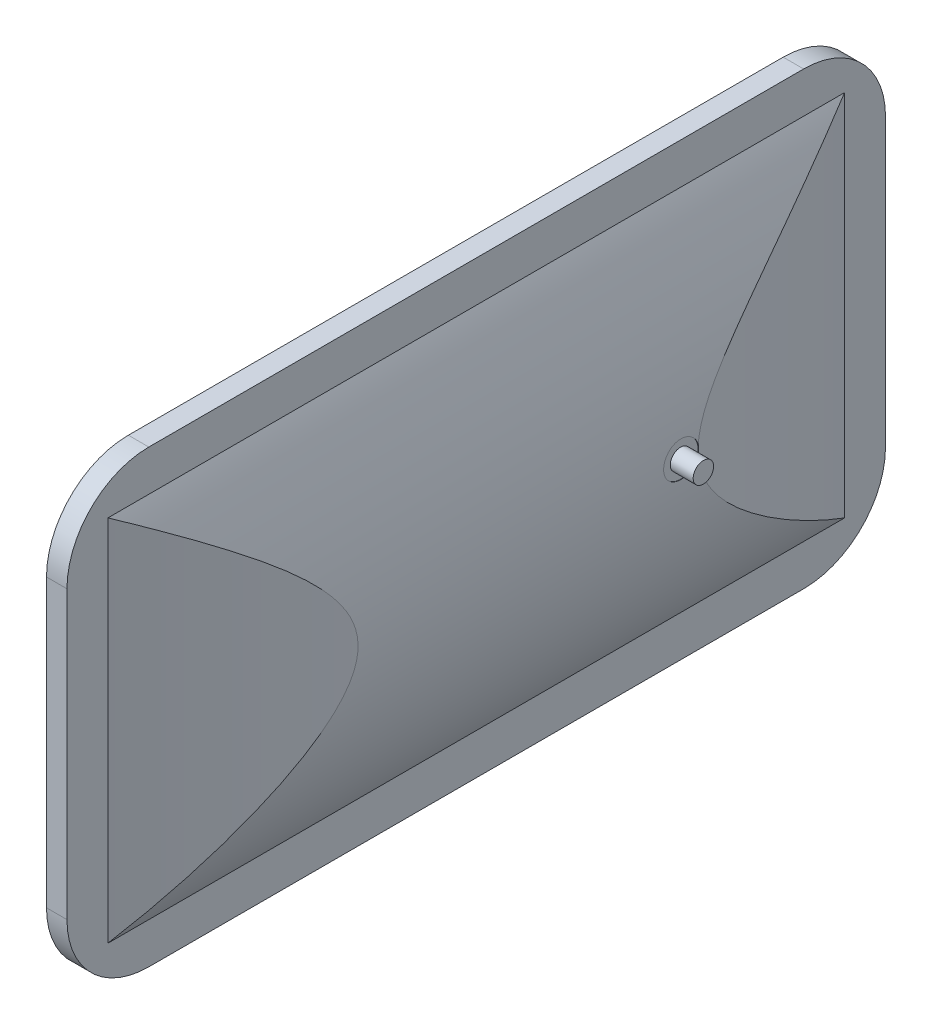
ISO-10303-21;
HEADER;
FILE_DESCRIPTION(('STEP AP214'),'2;1');
FILE_NAME('part.step','',(''),(''),'','','');
FILE_SCHEMA(('AUTOMOTIVE_DESIGN { 1 0 10303 214 1 1 1 1 }'));
ENDSEC;
DATA;
#1=APPLICATION_CONTEXT('core data for automotive mechanical design processes');
#2=APPLICATION_PROTOCOL_DEFINITION('international standard','automotive_design',2000,#1);
#3=PRODUCT_CONTEXT('',#1,'mechanical');
#4=PRODUCT('Part','Part','',(#3));
#5=PRODUCT_RELATED_PRODUCT_CATEGORY('part','',(#4));
#6=PRODUCT_DEFINITION_FORMATION('','',#4);
#7=PRODUCT_DEFINITION_CONTEXT('part definition',#1,'design');
#8=PRODUCT_DEFINITION('design','',#6,#7);
#9=PRODUCT_DEFINITION_SHAPE('','',#8);
#10=(LENGTH_UNIT() NAMED_UNIT(*) SI_UNIT(.MILLI.,.METRE.));
#11=(NAMED_UNIT(*) PLANE_ANGLE_UNIT() SI_UNIT($,.RADIAN.));
#12=(NAMED_UNIT(*) SI_UNIT($,.STERADIAN.) SOLID_ANGLE_UNIT());
#13=UNCERTAINTY_MEASURE_WITH_UNIT(LENGTH_MEASURE(1.E-05),#10,'distance_accuracy_value','');
#14=(GEOMETRIC_REPRESENTATION_CONTEXT(3) GLOBAL_UNCERTAINTY_ASSIGNED_CONTEXT((#13)) GLOBAL_UNIT_ASSIGNED_CONTEXT((#10,
#11,#12)) REPRESENTATION_CONTEXT('',''));
#15=CARTESIAN_POINT('',(0.,0.,0.));
#16=DIRECTION('',(0.,0.,1.));
#17=DIRECTION('',(1.,0.,0.));
#18=AXIS2_PLACEMENT_3D('',#15,#16,#17);
#19=CARTESIAN_POINT('',(19.05,69.85,79.4972497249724));
#20=DIRECTION('',(1.,0.,0.));
#21=DIRECTION('',(0.,0.,-1.));
#22=AXIS2_PLACEMENT_3D('',#19,#20,#21);
#23=PLANE('',#22);
#24=CARTESIAN_POINT('',(19.05,69.85,79.4972497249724));
#25=DIRECTION('',(1.,0.,0.));
#26=DIRECTION('',(0.,0.,-1.));
#27=AXIS2_PLACEMENT_3D('',#24,#25,#26);
#28=CIRCLE('',#27,5.46099999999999);
#29=CARTESIAN_POINT('',(19.05,69.85,74.0362497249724));
#30=VERTEX_POINT('',#29);
#31=EDGE_CURVE('E11',#30,#30,#28,.T.);
#32=ORIENTED_EDGE('',*,*,#31,.T.);
#33=EDGE_LOOP('',(#32));
#34=FACE_BOUND('',#33,.T.);
#35=CARTESIAN_POINT('',(19.05,69.85,79.4972497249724));
#36=DIRECTION('',(1.,0.,0.));
#37=DIRECTION('',(0.,0.,-1.));
#38=AXIS2_PLACEMENT_3D('',#35,#36,#37);
#39=CIRCLE('',#38,3.175);
#40=CARTESIAN_POINT('',(19.05,69.85,76.3222497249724));
#41=VERTEX_POINT('',#40);
#42=EDGE_CURVE('E491',#41,#41,#39,.T.);
#43=ORIENTED_EDGE('',*,*,#42,.F.);
#44=EDGE_LOOP('',(#43));
#45=FACE_BOUND('',#44,.T.);
#46=ADVANCED_FACE('F31',(#34,#45),#23,.T.);
#47=CARTESIAN_POINT('',(-90.1804598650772,69.85,254.));
#48=DIRECTION('',(0.,0.,-1.));
#49=DIRECTION('',(-1.,0.,0.));
#50=AXIS2_PLACEMENT_3D('',#47,#48,#49);
#51=CYLINDRICAL_SURFACE('',#50,109.459418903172);
#52=CARTESIAN_POINT('',(19.2789590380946,69.85,84.9582497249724));
#53=CARTESIAN_POINT('',(19.2789592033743,70.0033260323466,84.95825092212));
#54=CARTESIAN_POINT('',(19.2786362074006,70.156632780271,84.9517898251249));
#55=CARTESIAN_POINT('',(19.2773535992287,70.4622063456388,84.925991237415));
#56=CARTESIAN_POINT('',(19.2763938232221,70.6144728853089,84.9066504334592));
#57=CARTESIAN_POINT('',(19.2738633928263,70.9169622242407,84.855203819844));
#58=CARTESIAN_POINT('',(19.2722922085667,71.067183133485,84.8230869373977));
#59=CARTESIAN_POINT('',(19.2685829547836,71.364435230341,84.7463047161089));
#60=CARTESIAN_POINT('',(19.2664446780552,71.5114652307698,84.701634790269));
#61=CARTESIAN_POINT('',(19.2616642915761,71.8011046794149,84.6001156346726));
#62=CARTESIAN_POINT('',(19.2590226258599,71.9437178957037,84.5432771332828));
#63=CARTESIAN_POINT('',(19.2533080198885,72.223699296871,84.4177797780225));
#64=CARTESIAN_POINT('',(19.2502349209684,72.3610655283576,84.3491165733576));
#65=CARTESIAN_POINT('',(19.2437472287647,72.6294419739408,84.2005183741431));
#66=CARTESIAN_POINT('',(19.2403328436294,72.7604559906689,84.1205902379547));
#67=CARTESIAN_POINT('',(19.2332563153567,73.0153374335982,83.9499666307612));
#68=CARTESIAN_POINT('',(19.2295940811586,73.1392022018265,83.8592671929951));
#69=CARTESIAN_POINT('',(19.222124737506,73.3789176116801,83.6677187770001));
#70=CARTESIAN_POINT('',(19.2183175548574,73.4947641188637,83.5668646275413));
#71=CARTESIAN_POINT('',(19.2106665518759,73.7175940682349,83.3557215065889));
#72=CARTESIAN_POINT('',(19.2068227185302,73.8245742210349,83.2454290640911));
#73=CARTESIAN_POINT('',(19.1992100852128,74.0288315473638,83.0162609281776));
#74=CARTESIAN_POINT('',(19.1954412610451,74.1261118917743,82.8973880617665));
#75=CARTESIAN_POINT('',(19.1880828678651,74.3103534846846,82.6518239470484));
#76=CARTESIAN_POINT('',(19.1844933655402,74.3973109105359,82.525129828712));
#77=CARTESIAN_POINT('',(19.1775965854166,74.5602580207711,82.2648421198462));
#78=CARTESIAN_POINT('',(19.1742893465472,74.6362461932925,82.1312475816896));
#79=CARTESIAN_POINT('',(19.1680504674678,74.7767250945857,81.858076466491));
#80=CARTESIAN_POINT('',(19.1651189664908,74.841211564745,81.7184976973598));
#81=CARTESIAN_POINT('',(19.1597176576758,74.9581703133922,81.4344353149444));
#82=CARTESIAN_POINT('',(19.1572476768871,75.0106470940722,81.2899535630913));
#83=CARTESIAN_POINT('',(19.1528369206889,75.1032576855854,80.9970633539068));
#84=CARTESIAN_POINT('',(19.1508963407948,75.1433869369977,80.8486534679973));
#85=CARTESIAN_POINT('',(19.1459631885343,75.2446683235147,80.3994659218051));
#86=CARTESIAN_POINT('',(19.1438483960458,75.2869403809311,80.0941792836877));
#87=CARTESIAN_POINT('',(19.1422182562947,75.319612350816,79.4810020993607));
#88=CARTESIAN_POINT('',(19.142702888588,75.3100126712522,79.1731115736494));
#89=CARTESIAN_POINT('',(19.1462106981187,75.239316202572,78.5635535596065));
#90=CARTESIAN_POINT('',(19.1492316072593,75.1782654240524,78.2618807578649));
#91=CARTESIAN_POINT('',(19.1574690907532,75.0064531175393,77.6730825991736));
#92=CARTESIAN_POINT('',(19.1626856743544,74.8956913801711,77.3859573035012));
#93=CARTESIAN_POINT('',(19.1747288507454,74.6275535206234,76.834241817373));
#94=CARTESIAN_POINT('',(19.1815561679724,74.4701564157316,76.5696618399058));
#95=CARTESIAN_POINT('',(19.1960506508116,74.1132297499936,76.0706630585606));
#96=CARTESIAN_POINT('',(19.2037178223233,73.9136998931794,75.8362444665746));
#97=CARTESIAN_POINT('',(19.2190379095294,73.4779122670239,75.403953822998));
#98=CARTESIAN_POINT('',(19.2266908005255,73.2416146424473,75.2061219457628));
#99=CARTESIAN_POINT('',(19.2411117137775,72.7391390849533,74.8529303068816));
#100=CARTESIAN_POINT('',(19.2478797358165,72.4729611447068,74.6975705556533));
#101=CARTESIAN_POINT('',(19.2597684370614,71.9182573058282,74.4337370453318));
#102=CARTESIAN_POINT('',(19.2648890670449,71.629730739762,74.3252646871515));
#103=CARTESIAN_POINT('',(19.2729051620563,71.0385302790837,74.1583113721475));
#104=CARTESIAN_POINT('',(19.2758006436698,70.7358564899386,74.099830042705));
#105=CARTESIAN_POINT('',(19.2790379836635,70.1253021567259,74.0345683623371));
#106=CARTESIAN_POINT('',(19.2793825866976,69.8174275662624,74.0277324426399));
#107=CARTESIAN_POINT('',(19.2774866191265,69.2049044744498,74.0658106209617));
#108=CARTESIAN_POINT('',(19.2752460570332,68.900255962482,74.1107245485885));
#109=CARTESIAN_POINT('',(19.2684338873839,68.3029885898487,74.2509814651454));
#110=CARTESIAN_POINT('',(19.2638634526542,68.0103637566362,74.3462990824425));
#111=CARTESIAN_POINT('',(19.252906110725,67.4452663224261,74.5846320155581));
#112=CARTESIAN_POINT('',(19.2465191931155,67.1727938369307,74.7276476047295));
#113=CARTESIAN_POINT('',(19.232640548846,66.6554804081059,75.0574587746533));
#114=CARTESIAN_POINT('',(19.2251478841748,66.4106632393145,75.2442916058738));
#115=CARTESIAN_POINT('',(19.2099047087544,65.9558490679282,75.6563804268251));
#116=CARTESIAN_POINT('',(19.202154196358,65.7458522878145,75.8816366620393));
#117=CARTESIAN_POINT('',(19.1872610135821,65.3664524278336,76.3644130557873));
#118=CARTESIAN_POINT('',(19.1801188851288,65.1970853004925,76.6219614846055));
#119=CARTESIAN_POINT('',(19.1672565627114,64.9039998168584,77.1618837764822));
#120=CARTESIAN_POINT('',(19.161536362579,64.7802812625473,77.4442575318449));
#121=CARTESIAN_POINT('',(19.1521660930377,64.5820614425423,78.0256248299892));
#122=CARTESIAN_POINT('',(19.1485150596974,64.5075372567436,78.324610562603));
#123=CARTESIAN_POINT('',(19.143694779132,64.4097693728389,78.9310364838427));
#124=CARTESIAN_POINT('',(19.1425255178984,64.3865253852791,79.2384766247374));
#125=CARTESIAN_POINT('',(19.1427248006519,64.3905553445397,79.6988186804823));
#126=CARTESIAN_POINT('',(19.1431167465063,64.3983811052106,79.852128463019));
#127=CARTESIAN_POINT('',(19.1445354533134,64.4268986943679,80.1575284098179));
#128=CARTESIAN_POINT('',(19.1455619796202,64.4475857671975,80.3096190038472));
#129=CARTESIAN_POINT('',(19.1482222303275,64.5016937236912,80.6115595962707));
#130=CARTESIAN_POINT('',(19.1498561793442,64.535119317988,80.7614087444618));
#131=CARTESIAN_POINT('',(19.1536837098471,64.6144472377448,81.0577036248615));
#132=CARTESIAN_POINT('',(19.1558770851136,64.6603449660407,81.2041505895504));
#133=CARTESIAN_POINT('',(19.1607624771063,64.7643152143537,81.4927096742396));
#134=CARTESIAN_POINT('',(19.1634546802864,64.8223922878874,81.6348201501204));
#135=CARTESIAN_POINT('',(19.1692596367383,64.950273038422,81.9135908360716));
#136=CARTESIAN_POINT('',(19.1723722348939,65.0200723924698,82.0502530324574));
#137=CARTESIAN_POINT('',(19.1789316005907,65.1709418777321,82.3172599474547));
#138=CARTESIAN_POINT('',(19.1823784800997,65.2520157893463,82.4476025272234));
#139=CARTESIAN_POINT('',(19.1895065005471,65.4248090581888,82.7009520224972));
#140=CARTESIAN_POINT('',(19.193187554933,65.5165244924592,82.8239616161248));
#141=CARTESIAN_POINT('',(19.2006859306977,65.7101059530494,83.0619885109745));
#142=CARTESIAN_POINT('',(19.2045034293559,65.8119855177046,83.1769947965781));
#143=CARTESIAN_POINT('',(19.2121602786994,66.0250295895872,83.3979764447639));
#144=CARTESIAN_POINT('',(19.2159996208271,66.1361906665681,83.5039551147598));
#145=CARTESIAN_POINT('',(19.2235950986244,66.3671140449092,83.7062403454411));
#146=CARTESIAN_POINT('',(19.2273511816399,66.4868815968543,83.8025409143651));
#147=CARTESIAN_POINT('',(19.2346697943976,66.7340623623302,83.9846780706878));
#148=CARTESIAN_POINT('',(19.2382323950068,66.8614727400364,84.0705185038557));
#149=CARTESIAN_POINT('',(19.2450690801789,67.1232502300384,84.2312733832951));
#150=CARTESIAN_POINT('',(19.2483427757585,67.2576263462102,84.3061731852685));
#151=CARTESIAN_POINT('',(19.2545021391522,67.5321728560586,84.4443506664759));
#152=CARTESIAN_POINT('',(19.2573879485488,67.6723411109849,84.50763258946));
#153=CARTESIAN_POINT('',(19.2626886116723,67.9573997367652,84.6221061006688));
#154=CARTESIAN_POINT('',(19.2651038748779,68.1022858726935,84.6733082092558));
#155=CARTESIAN_POINT('',(19.2693975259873,68.39581557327,84.7633140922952));
#156=CARTESIAN_POINT('',(19.2712760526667,68.5444581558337,84.8021210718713));
#157=CARTESIAN_POINT('',(19.2748615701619,68.8841244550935,84.8756541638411));
#158=CARTESIAN_POINT('',(19.2763924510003,69.0759801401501,84.9066003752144));
#159=CARTESIAN_POINT('',(19.2784410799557,69.4619008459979,84.9478973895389));
#160=CARTESIAN_POINT('',(19.2789588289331,69.6559658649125,84.9582482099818));
#161=CARTESIAN_POINT('',(19.2789590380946,69.85,84.9582497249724));
#162=B_SPLINE_CURVE_WITH_KNOTS('',3,(#52,#53,#54,#55,#56,#57,#58,#59,#60,#61,#62,#63,#64,#65,
#66,#67,#68,#69,#70,#71,#72,#73,#74,#75,#76,#77,#78,#79,#80,#81,#82,#83,#84,#85,#86,#87,#88,#89,
#90,#91,#92,#93,#94,#95,#96,#97,#98,#99,#100,#101,#102,#103,#104,#105,#106,#107,#108,#109,#110,
#111,#112,#113,#114,#115,#116,#117,#118,#119,#120,#121,#122,#123,#124,#125,#126,#127,#128,#129,
#130,#131,#132,#133,#134,#135,#136,#137,#138,#139,#140,#141,#142,#143,#144,#145,#146,#147,#148,
#149,#150,#151,#152,#153,#154,#155,#156,#157,#158,#159,#160,#161),.UNSPECIFIED.,.T.,.F.,(4,2,2,
2,2,2,2,2,2,2,2,2,2,2,2,2,2,2,2,2,2,2,2,2,2,2,2,2,2,2,2,2,2,2,2,2,2,2,2,2,2,2,2,2,2,2,2,2,2,2,2,
2,2,2,4),(0.,0.459808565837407,0.919735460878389,1.38006183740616,1.8405566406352,
2.30064711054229,2.76090722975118,3.22088833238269,3.68103936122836,4.14142591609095,
4.60198251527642,5.06238806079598,5.52296356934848,5.98360249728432,6.44441162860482,
6.90504772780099,7.36585371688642,8.28570075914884,9.2055405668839,10.1245586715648,
11.0435806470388,11.9630167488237,12.8824593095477,13.8029055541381,14.7233520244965,
15.6438259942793,16.5642931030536,17.48376967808,18.4032432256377,19.3222543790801,
20.2412707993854,21.161071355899,22.080877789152,23.0014951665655,23.9221085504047,
24.8422927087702,25.7624716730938,26.2225538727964,26.6824660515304,27.1425484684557,
27.6024615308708,28.0625468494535,28.522462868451,28.9825334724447,29.4424350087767,
29.9029575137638,30.3633105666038,30.823946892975,31.2844133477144,31.7454906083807,
32.2063991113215,32.6669047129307,33.1272911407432,33.7091794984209,34.2910673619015),.UNSPECIFIED.);
#163=CARTESIAN_POINT('',(19.2715583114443,68.5771670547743,74.1866549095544));
#164=VERTEX_POINT('',#163);
#165=CARTESIAN_POINT('',(19.271558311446,71.1228329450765,74.186654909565));
#166=VERTEX_POINT('',#165);
#167=EDGE_CURVE('E131',#164,#166,#162,.T.);
#168=ORIENTED_EDGE('',*,*,#167,.T.);
#169=CARTESIAN_POINT('',(3.17500000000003,127.,12.7));
#170=CARTESIAN_POINT('',(3.57957955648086,126.339098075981,13.8012677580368));
#171=CARTESIAN_POINT('',(3.97739802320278,125.67350898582,14.9022068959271));
#172=CARTESIAN_POINT('',(4.75955150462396,124.332671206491,17.1030035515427));
#173=CARTESIAN_POINT('',(5.14388642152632,123.657422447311,18.2028610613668));
#174=CARTESIAN_POINT('',(5.89917657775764,122.296861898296,20.4012605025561));
#175=CARTESIAN_POINT('',(6.27012929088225,121.61154824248,21.4998021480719));
#176=CARTESIAN_POINT('',(6.99859959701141,120.230591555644,23.6948261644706));
#177=CARTESIAN_POINT('',(7.35611722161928,119.534948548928,24.7913085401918));
#178=CARTESIAN_POINT('',(8.40586509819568,117.437204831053,28.0684546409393));
#179=CARTESIAN_POINT('',(9.07820427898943,116.019045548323,30.2453093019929));
#180=CARTESIAN_POINT('',(10.0467356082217,113.855648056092,33.4981939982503));
#181=CARTESIAN_POINT('',(10.362906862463,113.128513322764,34.5803877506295));
#182=CARTESIAN_POINT('',(10.9819155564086,111.661151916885,36.7396988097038));
#183=CARTESIAN_POINT('',(11.2847531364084,110.920925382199,37.8168161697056));
#184=CARTESIAN_POINT('',(11.9654387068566,109.203141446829,40.2853629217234));
#185=CARTESIAN_POINT('',(12.3386991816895,108.220686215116,41.6746576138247));
#186=CARTESIAN_POINT('',(13.0625048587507,106.228266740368,44.4395152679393));
#187=CARTESIAN_POINT('',(13.4130489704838,105.218301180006,45.815077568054));
#188=CARTESIAN_POINT('',(14.0923398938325,103.162520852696,48.5529215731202));
#189=CARTESIAN_POINT('',(14.4210016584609,102.116587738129,49.9151356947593));
#190=CARTESIAN_POINT('',(15.0545559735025,99.9862192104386,52.6145850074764));
#191=CARTESIAN_POINT('',(15.3594524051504,98.9017901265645,53.9518242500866));
#192=CARTESIAN_POINT('',(15.7994847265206,97.235188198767,55.9370250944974));
#193=CARTESIAN_POINT('',(15.9438031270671,96.6707234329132,56.5978414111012));
#194=CARTESIAN_POINT('',(16.2260229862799,95.5282252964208,57.90901549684));
#195=CARTESIAN_POINT('',(16.3639246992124,94.9501924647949,58.5593736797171));
#196=CARTESIAN_POINT('',(16.6332231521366,93.7782946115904,59.8481411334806));
#197=CARTESIAN_POINT('',(16.7646140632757,93.184416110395,60.4865393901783));
#198=CARTESIAN_POINT('',(17.0204704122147,91.9792664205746,61.7480787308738));
#199=CARTESIAN_POINT('',(17.1449363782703,91.3679965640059,62.3712209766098));
#200=CARTESIAN_POINT('',(17.3861126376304,90.1279281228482,63.5964785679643));
#201=CARTESIAN_POINT('',(17.5028509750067,89.4992061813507,64.1986657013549));
#202=CARTESIAN_POINT('',(17.7286084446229,88.2189947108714,65.3801263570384));
#203=CARTESIAN_POINT('',(17.8376265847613,87.5675022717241,65.9593969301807));
#204=CARTESIAN_POINT('',(18.0470807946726,86.2394809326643,67.0881125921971));
#205=CARTESIAN_POINT('',(18.1475298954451,85.5629923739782,67.6376024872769));
#206=CARTESIAN_POINT('',(18.3390722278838,84.1804730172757,68.6996304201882));
#207=CARTESIAN_POINT('',(18.430168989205,83.4744535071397,69.2121823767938));
#208=CARTESIAN_POINT('',(18.5841199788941,82.1773993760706,70.0893298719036));
#209=CARTESIAN_POINT('',(18.6489313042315,81.5925451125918,70.4626872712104));
#210=CARTESIAN_POINT('',(18.7710200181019,80.3998246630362,71.1725501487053));
#211=CARTESIAN_POINT('',(18.8282964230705,79.7919554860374,71.5090508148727));
#212=CARTESIAN_POINT('',(18.9341166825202,78.5539347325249,72.1358591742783));
#213=CARTESIAN_POINT('',(18.9826830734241,77.9238458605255,72.4262858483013));
#214=CARTESIAN_POINT('',(19.0700151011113,76.6405095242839,72.9520650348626));
#215=CARTESIAN_POINT('',(19.1087865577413,75.9872760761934,73.1874502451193));
#216=CARTESIAN_POINT('',(19.16655479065,74.8335554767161,73.5399151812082));
#217=CARTESIAN_POINT('',(19.1880715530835,74.3377225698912,73.6718374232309));
#218=CARTESIAN_POINT('',(19.2245430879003,73.337125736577,73.8960535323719));
#219=CARTESIAN_POINT('',(19.2395015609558,72.8323670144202,73.9883697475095));
#220=CARTESIAN_POINT('',(19.2624642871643,71.8168615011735,74.1302911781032));
#221=CARTESIAN_POINT('',(19.2704711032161,71.3061169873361,74.1799121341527));
#222=CARTESIAN_POINT('',(19.2793032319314,70.2821547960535,74.2346561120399));
#223=CARTESIAN_POINT('',(19.2801284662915,69.7689370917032,74.2397786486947));
#224=CARTESIAN_POINT('',(19.2745701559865,68.7438022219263,74.2053164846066));
#225=CARTESIAN_POINT('',(19.2681830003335,68.2318858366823,74.1657093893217));
#226=CARTESIAN_POINT('',(19.2483865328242,67.213441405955,74.04324994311));
#227=CARTESIAN_POINT('',(19.2349771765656,66.7069133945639,73.9603973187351));
#228=CARTESIAN_POINT('',(19.2014980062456,65.7021658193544,73.7542857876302));
#229=CARTESIAN_POINT('',(19.1814247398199,65.2039507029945,73.6310059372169));
#230=CARTESIAN_POINT('',(19.1351003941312,64.2182745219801,73.3478258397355));
#231=CARTESIAN_POINT('',(19.1088472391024,63.7308171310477,73.1879132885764));
#232=CARTESIAN_POINT('',(19.0349511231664,62.5076191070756,72.7402935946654));
#233=CARTESIAN_POINT('',(18.9834208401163,61.7802571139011,72.4302578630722));
#234=CARTESIAN_POINT('',(18.8688157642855,60.356259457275,71.7480289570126));
#235=CARTESIAN_POINT('',(18.8057335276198,59.6596439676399,71.3757957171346));
#236=CARTESIAN_POINT('',(18.6693959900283,58.2937884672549,70.5807377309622));
#237=CARTESIAN_POINT('',(18.5961044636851,57.6246574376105,70.1577336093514));
#238=CARTESIAN_POINT('',(18.4408228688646,56.3142548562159,69.2727662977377));
#239=CARTESIAN_POINT('',(18.358835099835,55.6729760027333,68.8108134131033));
#240=CARTESIAN_POINT('',(18.1430424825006,54.0922339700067,67.6108879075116));
#241=CARTESIAN_POINT('',(18.0042402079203,53.1686571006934,66.8529384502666));
#242=CARTESIAN_POINT('',(17.7112193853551,51.3680688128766,65.2860597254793));
#243=CARTESIAN_POINT('',(17.556991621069,50.4910857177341,64.4771000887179));
#244=CARTESIAN_POINT('',(17.2343379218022,48.774186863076,62.8200535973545));
#245=CARTESIAN_POINT('',(17.0658825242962,47.9343537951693,61.9718872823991));
#246=CARTESIAN_POINT('',(16.7161070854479,46.2873884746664,60.2474720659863));
#247=CARTESIAN_POINT('',(16.5347898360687,45.4802491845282,59.3712292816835));
#248=CARTESIAN_POINT('',(16.1583755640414,43.886715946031,57.5895844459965));
#249=CARTESIAN_POINT('',(15.9631765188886,43.1005502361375,56.6840005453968));
#250=CARTESIAN_POINT('',(15.5608211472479,41.5518401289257,54.8554491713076));
#251=CARTESIAN_POINT('',(15.3536643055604,40.78929675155,53.9324809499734));
#252=CARTESIAN_POINT('',(14.9279965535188,39.285534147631,52.0739000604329));
#253=CARTESIAN_POINT('',(14.7095000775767,38.5442895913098,51.1383045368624));
#254=CARTESIAN_POINT('',(14.261143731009,37.0795521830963,49.2559915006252));
#255=CARTESIAN_POINT('',(14.0312835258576,36.3560598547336,48.3092736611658));
#256=CARTESIAN_POINT('',(13.4435001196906,34.5695388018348,45.9346807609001));
#257=CARTESIAN_POINT('',(13.0786406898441,33.5162183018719,44.5012139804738));
#258=CARTESIAN_POINT('',(12.3242134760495,31.4393712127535,41.6192623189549));
#259=CARTESIAN_POINT('',(11.9346447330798,30.4158457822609,40.1707768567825));
#260=CARTESIAN_POINT('',(11.1307624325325,28.3941852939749,37.261642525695));
#261=CARTESIAN_POINT('',(10.7164339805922,27.3960660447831,35.8009867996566));
#262=CARTESIAN_POINT('',(9.86334614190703,25.4230229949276,32.8711699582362));
#263=CARTESIAN_POINT('',(9.42458656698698,24.4480993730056,31.4020087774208));
#264=CARTESIAN_POINT('',(8.5361354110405,22.5481520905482,28.5012985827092));
#265=CARTESIAN_POINT('',(8.08716121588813,21.6225076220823,27.0699360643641));
#266=CARTESIAN_POINT('',(7.16623617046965,19.7896676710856,24.2027906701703));
#267=CARTESIAN_POINT('',(6.69428518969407,18.8824722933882,22.7670077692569));
#268=CARTESIAN_POINT('',(5.7278673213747,17.0864108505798,19.8938065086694));
#269=CARTESIAN_POINT('',(5.2334243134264,16.1975267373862,18.4563913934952));
#270=CARTESIAN_POINT('',(4.22150617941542,14.4364356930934,15.5794955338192));
#271=CARTESIAN_POINT('',(3.70403151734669,13.5642284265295,14.1400148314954));
#272=CARTESIAN_POINT('',(3.17500000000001,12.7000000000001,12.7));
#273=B_SPLINE_CURVE_WITH_KNOTS('',3,(#169,#170,#171,#172,#173,#174,#175,#176,#177,#178,#179,
#180,#181,#182,#183,#184,#185,#186,#187,#188,#189,#190,#191,#192,#193,#194,#195,#196,#197,#198,
#199,#200,#201,#202,#203,#204,#205,#206,#207,#208,#209,#210,#211,#212,#213,#214,#215,#216,#217,
#218,#219,#220,#221,#222,#223,#224,#225,#226,#227,#228,#229,#230,#231,#232,#233,#234,#235,#236,
#237,#238,#239,#240,#241,#242,#243,#244,#245,#246,#247,#248,#249,#250,#251,#252,#253,#254,#255,
#256,#257,#258,#259,#260,#261,#262,#263,#264,#265,#266,#267,#268,#269,#270,#271,#272),
.UNSPECIFIED.,.F.,.F.,(4,2,2,2,2,2,2,2,2,2,2,2,2,2,2,2,2,2,2,2,2,2,2,2,2,2,2,2,2,2,2,2,2,2,2,2,
2,2,2,2,2,2,2,2,2,2,2,2,2,2,2,4),(0.,4.03970209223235,8.07943347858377,12.1199235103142,
16.1604040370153,24.2101818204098,28.2348094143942,32.2593946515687,37.4851136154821,
42.7110832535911,47.9563028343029,53.2006639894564,55.8434538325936,58.4861388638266,
61.1311485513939,63.7759561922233,66.4105697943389,69.0455213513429,71.6763917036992,
74.3062654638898,76.3957846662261,78.4855763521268,80.5698803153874,82.6529429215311,
84.1920815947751,85.7303506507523,87.2680523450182,88.8057708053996,90.3442594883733,
91.8827578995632,93.4220546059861,94.9618690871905,97.3348906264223,99.7094467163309,
102.092653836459,104.475232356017,108.080670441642,111.688275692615,115.30354386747,
118.918029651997,122.562563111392,126.207253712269,129.847413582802,133.487680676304,
138.93474763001,144.382026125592,149.832615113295,155.283246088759,160.571157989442,
165.859099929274,171.141553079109,176.42389985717),.UNSPECIFIED.);
#274=CARTESIAN_POINT('',(3.17500000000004,127.,12.7));
#275=VERTEX_POINT('',#274);
#276=EDGE_CURVE('E141',#275,#166,#273,.T.);
#277=ORIENTED_EDGE('',*,*,#276,.F.);
#278=DIRECTION('',(0.,0.,-1.));
#279=VECTOR('',#278,1.);
#280=CARTESIAN_POINT('',(3.17500000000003,127.,254.));
#281=LINE('',#280,#279);
#282=CARTESIAN_POINT('',(3.17500000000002,127.,241.3));
#283=VERTEX_POINT('',#282);
#284=EDGE_CURVE('E286',#283,#275,#281,.T.);
#285=ORIENTED_EDGE('',*,*,#284,.F.);
#286=CARTESIAN_POINT('',(3.17500000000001,12.7,241.3));
#287=CARTESIAN_POINT('',(3.57957955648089,13.3609019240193,240.198732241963));
#288=CARTESIAN_POINT('',(3.97739802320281,14.0264910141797,239.097793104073));
#289=CARTESIAN_POINT('',(4.75955150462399,15.3673287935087,236.896996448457));
#290=CARTESIAN_POINT('',(5.14388642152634,16.0425775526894,235.797138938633));
#291=CARTESIAN_POINT('',(5.89917657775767,17.4031381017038,233.598739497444));
#292=CARTESIAN_POINT('',(6.2701292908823,18.0884517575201,232.500197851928));
#293=CARTESIAN_POINT('',(6.99859959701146,19.4694084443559,230.305173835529));
#294=CARTESIAN_POINT('',(7.3561172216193,20.1650514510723,229.208691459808));
#295=CARTESIAN_POINT('',(8.40586509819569,22.2627951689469,225.93154535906));
#296=CARTESIAN_POINT('',(9.0782042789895,23.6809544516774,223.754690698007));
#297=CARTESIAN_POINT('',(10.0467356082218,25.844351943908,220.50180600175));
#298=CARTESIAN_POINT('',(10.3629068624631,26.5714866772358,219.41961224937));
#299=CARTESIAN_POINT('',(10.9819155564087,28.0388480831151,217.260301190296));
#300=CARTESIAN_POINT('',(11.2847531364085,28.7790746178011,216.183183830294));
#301=CARTESIAN_POINT('',(11.9654387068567,30.4968585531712,213.714637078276));
#302=CARTESIAN_POINT('',(12.3386991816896,31.4793137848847,212.325342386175));
#303=CARTESIAN_POINT('',(13.0625048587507,33.4717332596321,209.56048473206));
#304=CARTESIAN_POINT('',(13.4130489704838,34.4816988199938,208.184922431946));
#305=CARTESIAN_POINT('',(14.0923398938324,36.5374791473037,205.44707842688));
#306=CARTESIAN_POINT('',(14.4210016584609,37.5834122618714,204.084864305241));
#307=CARTESIAN_POINT('',(15.0545559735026,39.7137807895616,201.385414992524));
#308=CARTESIAN_POINT('',(15.3594524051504,40.7982098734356,200.048175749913));
#309=CARTESIAN_POINT('',(15.7994847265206,42.4648118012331,198.062974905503));
#310=CARTESIAN_POINT('',(15.9438031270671,43.0292765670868,197.402158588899));
#311=CARTESIAN_POINT('',(16.2260229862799,44.1717747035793,196.09098450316));
#312=CARTESIAN_POINT('',(16.3639246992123,44.7498075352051,195.440626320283));
#313=CARTESIAN_POINT('',(16.6332231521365,45.9217053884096,194.151858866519));
#314=CARTESIAN_POINT('',(16.7646140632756,46.5155838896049,193.513460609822));
#315=CARTESIAN_POINT('',(17.0204704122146,47.7207335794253,192.251921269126));
#316=CARTESIAN_POINT('',(17.1449363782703,48.332003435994,191.62877902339));
#317=CARTESIAN_POINT('',(17.3861126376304,49.5720718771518,190.403521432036));
#318=CARTESIAN_POINT('',(17.5028509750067,50.2007938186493,189.801334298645));
#319=CARTESIAN_POINT('',(17.7286084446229,51.4810052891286,188.619873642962));
#320=CARTESIAN_POINT('',(17.8376265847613,52.1324977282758,188.040603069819));
#321=CARTESIAN_POINT('',(18.0470807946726,53.4605190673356,186.911887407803));
#322=CARTESIAN_POINT('',(18.1475298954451,54.1370076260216,186.362397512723));
#323=CARTESIAN_POINT('',(18.3390722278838,55.5195269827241,185.300369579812));
#324=CARTESIAN_POINT('',(18.430168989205,56.2255464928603,184.787817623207));
#325=CARTESIAN_POINT('',(18.5841199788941,57.5226006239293,183.910670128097));
#326=CARTESIAN_POINT('',(18.6489313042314,58.107454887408,183.53731272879));
#327=CARTESIAN_POINT('',(18.7710200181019,59.3001753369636,182.827449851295));
#328=CARTESIAN_POINT('',(18.8282964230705,59.9080445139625,182.490949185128));
#329=CARTESIAN_POINT('',(18.9341166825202,61.146065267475,181.864140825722));
#330=CARTESIAN_POINT('',(18.9826830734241,61.7761541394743,181.573714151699));
#331=CARTESIAN_POINT('',(19.0700151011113,63.0594904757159,181.047934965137));
#332=CARTESIAN_POINT('',(19.1087865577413,63.7127239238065,180.812549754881));
#333=CARTESIAN_POINT('',(19.16655479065,64.8664445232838,180.460084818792));
#334=CARTESIAN_POINT('',(19.1880715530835,65.3622774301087,180.328162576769));
#335=CARTESIAN_POINT('',(19.2245430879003,66.3628742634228,180.103946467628));
#336=CARTESIAN_POINT('',(19.2395015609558,66.8676329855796,180.011630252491));
#337=CARTESIAN_POINT('',(19.2624642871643,67.8831384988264,179.869708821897));
#338=CARTESIAN_POINT('',(19.2704711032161,68.3938830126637,179.820087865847));
#339=CARTESIAN_POINT('',(19.2793032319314,69.4178452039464,179.76534388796));
#340=CARTESIAN_POINT('',(19.2801284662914,69.9310629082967,179.760221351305));
#341=CARTESIAN_POINT('',(19.2745701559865,70.9561977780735,179.794683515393));
#342=CARTESIAN_POINT('',(19.2681830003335,71.4681141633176,179.834290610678));
#343=CARTESIAN_POINT('',(19.2483865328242,72.4865585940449,179.95675005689));
#344=CARTESIAN_POINT('',(19.2349771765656,72.993086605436,180.039602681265));
#345=CARTESIAN_POINT('',(19.2014980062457,73.9978341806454,180.24571421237));
#346=CARTESIAN_POINT('',(19.1814247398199,74.4960492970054,180.368994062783));
#347=CARTESIAN_POINT('',(19.1351003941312,75.4817254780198,180.652174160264));
#348=CARTESIAN_POINT('',(19.1088472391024,75.9691828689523,180.812086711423));
#349=CARTESIAN_POINT('',(19.0349511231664,77.1923808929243,181.259706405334));
#350=CARTESIAN_POINT('',(18.9834208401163,77.9197428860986,181.569742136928));
#351=CARTESIAN_POINT('',(18.8688157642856,79.3437405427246,182.251971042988));
#352=CARTESIAN_POINT('',(18.8057335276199,80.0403560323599,182.624204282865));
#353=CARTESIAN_POINT('',(18.6693959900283,81.4062115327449,183.419262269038));
#354=CARTESIAN_POINT('',(18.5961044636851,82.0753425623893,183.842266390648));
#355=CARTESIAN_POINT('',(18.4408228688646,83.3857451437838,184.727233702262));
#356=CARTESIAN_POINT('',(18.358835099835,84.0270239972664,185.189186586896));
#357=CARTESIAN_POINT('',(18.1430424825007,85.607766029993,186.389112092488));
#358=CARTESIAN_POINT('',(18.0042402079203,86.5313428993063,187.147061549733));
#359=CARTESIAN_POINT('',(17.7112193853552,88.331931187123,188.71394027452));
#360=CARTESIAN_POINT('',(17.5569916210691,89.2089142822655,189.522899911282));
#361=CARTESIAN_POINT('',(17.2343379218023,90.9258131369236,191.179946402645));
#362=CARTESIAN_POINT('',(17.0658825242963,91.7656462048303,192.0281127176));
#363=CARTESIAN_POINT('',(16.716107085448,93.4126115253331,193.752527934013));
#364=CARTESIAN_POINT('',(16.5347898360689,94.2197508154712,194.628770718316));
#365=CARTESIAN_POINT('',(16.1583755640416,95.8132840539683,196.410415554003));
#366=CARTESIAN_POINT('',(15.9631765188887,96.599449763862,197.315999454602));
#367=CARTESIAN_POINT('',(15.560821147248,98.1481598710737,199.144550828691));
#368=CARTESIAN_POINT('',(15.3536643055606,98.9107032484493,200.067519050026));
#369=CARTESIAN_POINT('',(14.927996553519,100.414465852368,201.926099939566));
#370=CARTESIAN_POINT('',(14.709500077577,101.155710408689,202.861695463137));
#371=CARTESIAN_POINT('',(14.2611437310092,102.620447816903,204.744008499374));
#372=CARTESIAN_POINT('',(14.0312835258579,103.343940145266,205.690726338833));
#373=CARTESIAN_POINT('',(13.4435001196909,105.130461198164,208.065319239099));
#374=CARTESIAN_POINT('',(13.0786406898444,106.183781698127,209.498786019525));
#375=CARTESIAN_POINT('',(12.3242134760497,108.260628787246,212.380737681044));
#376=CARTESIAN_POINT('',(11.9346447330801,109.284154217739,213.829223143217));
#377=CARTESIAN_POINT('',(11.1307624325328,111.305814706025,216.738357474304));
#378=CARTESIAN_POINT('',(10.7164339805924,112.303933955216,218.199013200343));
#379=CARTESIAN_POINT('',(9.8633461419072,114.276977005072,221.128830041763));
#380=CARTESIAN_POINT('',(9.42458656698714,115.251900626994,222.597991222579));
#381=CARTESIAN_POINT('',(8.53613541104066,117.151847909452,225.49870141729));
#382=CARTESIAN_POINT('',(8.08716121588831,118.077492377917,226.930063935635));
#383=CARTESIAN_POINT('',(7.1662361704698,119.910332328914,229.797209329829));
#384=CARTESIAN_POINT('',(6.69428518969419,120.817527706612,231.232992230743));
#385=CARTESIAN_POINT('',(5.72786732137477,122.61358914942,234.10619349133));
#386=CARTESIAN_POINT('',(5.23342431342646,123.502473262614,235.543608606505));
#387=CARTESIAN_POINT('',(4.22150617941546,125.263564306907,238.420504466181));
#388=CARTESIAN_POINT('',(3.70403151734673,126.135771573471,239.859985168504));
#389=CARTESIAN_POINT('',(3.17500000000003,127.,241.3));
#390=B_SPLINE_CURVE_WITH_KNOTS('',3,(#286,#287,#288,#289,#290,#291,#292,#293,#294,#295,#296,
#297,#298,#299,#300,#301,#302,#303,#304,#305,#306,#307,#308,#309,#310,#311,#312,#313,#314,#315,
#316,#317,#318,#319,#320,#321,#322,#323,#324,#325,#326,#327,#328,#329,#330,#331,#332,#333,#334,
#335,#336,#337,#338,#339,#340,#341,#342,#343,#344,#345,#346,#347,#348,#349,#350,#351,#352,#353,
#354,#355,#356,#357,#358,#359,#360,#361,#362,#363,#364,#365,#366,#367,#368,#369,#370,#371,#372,
#373,#374,#375,#376,#377,#378,#379,#380,#381,#382,#383,#384,#385,#386,#387,#388,#389),
.UNSPECIFIED.,.F.,.F.,(4,2,2,2,2,2,2,2,2,2,2,2,2,2,2,2,2,2,2,2,2,2,2,2,2,2,2,2,2,2,2,2,2,2,2,2,
2,2,2,2,2,2,2,2,2,2,2,2,2,2,2,4),(0.,4.03970209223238,8.07943347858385,12.1199235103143,
16.1604040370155,24.2101818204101,28.2348094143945,32.2593946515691,37.4851136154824,
42.7110832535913,47.9563028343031,53.2006639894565,55.8434538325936,58.4861388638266,
61.1311485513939,63.7759561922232,66.4105697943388,69.0455213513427,71.676391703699,
74.3062654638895,76.3957846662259,78.4855763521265,80.5698803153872,82.6529429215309,
84.1920815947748,85.7303506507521,87.268052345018,88.8057708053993,90.3442594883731,
91.882757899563,93.4220546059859,94.9618690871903,97.334890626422,99.7094467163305,
102.092653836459,104.475232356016,108.080670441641,111.688275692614,115.303543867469,
118.918029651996,122.562563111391,126.207253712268,129.847413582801,133.487680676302,
138.934747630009,144.382026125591,149.832615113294,155.283246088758,160.571157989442,
165.859099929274,171.141553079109,176.42389985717),.UNSPECIFIED.);
#391=CARTESIAN_POINT('',(3.17500000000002,12.7,241.3));
#392=VERTEX_POINT('',#391);
#393=EDGE_CURVE('E150',#392,#283,#390,.T.);
#394=ORIENTED_EDGE('',*,*,#393,.F.);
#395=DIRECTION('',(0.,0.,-1.));
#396=VECTOR('',#395,1.);
#397=CARTESIAN_POINT('',(3.17499999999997,12.7,254.));
#398=LINE('',#397,#396);
#399=CARTESIAN_POINT('',(3.17500000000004,12.7000000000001,12.7));
#400=VERTEX_POINT('',#399);
#401=EDGE_CURVE('E284',#392,#400,#398,.T.);
#402=ORIENTED_EDGE('',*,*,#401,.T.);
#403=EDGE_CURVE('E144',#164,#400,#273,.T.);
#404=ORIENTED_EDGE('',*,*,#403,.F.);
#405=EDGE_LOOP('',(#168,#277,#285,#394,#402,#404));
#406=FACE_BOUND('',#405,.T.);
#407=ADVANCED_FACE('F139',(#406),#51,.T.);
#408=CARTESIAN_POINT('',(-307.951801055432,0.,127.));
#409=DIRECTION('',(0.,1.,0.));
#410=DIRECTION('',(0.,0.,1.));
#411=AXIS2_PLACEMENT_3D('',#408,#409,#410);
#412=CYLINDRICAL_SURFACE('',#411,331.45795560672);
#413=ORIENTED_EDGE('',*,*,#276,.T.);
#414=CARTESIAN_POINT('',(19.2799590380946,68.3767381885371,74.2387308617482));
#415=CARTESIAN_POINT('',(19.273287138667,68.5243534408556,74.1973557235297));
#416=CARTESIAN_POINT('',(19.2676145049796,68.6737600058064,74.1622187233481));
#417=CARTESIAN_POINT('',(19.2583076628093,68.9750922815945,74.104611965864));
#418=CARTESIAN_POINT('',(19.2546739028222,69.1270185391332,74.0821449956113));
#419=CARTESIAN_POINT('',(19.2495466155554,69.4287916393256,74.0504519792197));
#420=CARTESIAN_POINT('',(19.2480063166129,69.5786072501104,74.0409365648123));
#421=CARTESIAN_POINT('',(19.2469264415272,69.8784524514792,74.0342651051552));
#422=CARTESIAN_POINT('',(19.2473861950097,70.0284819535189,74.0371049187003));
#423=CARTESIAN_POINT('',(19.2507179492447,70.3703354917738,74.057691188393));
#424=CARTESIAN_POINT('',(19.2542376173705,70.5619350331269,74.0794400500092));
#425=CARTESIAN_POINT('',(19.2619798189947,70.84807389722,74.1273398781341));
#426=CARTESIAN_POINT('',(19.2650031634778,70.9439568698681,74.146051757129));
#427=CARTESIAN_POINT('',(19.2718695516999,71.1345477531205,74.188579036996));
#428=CARTESIAN_POINT('',(19.2757125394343,71.2292557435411,74.2123940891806));
#429=CARTESIAN_POINT('',(19.2799590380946,71.323261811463,74.2387308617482));
#430=B_SPLINE_CURVE_WITH_KNOTS('',3,(#414,#415,#416,#417,#418,#419,#420,#421,#422,#423,#424,
#425,#426,#427,#428,#429),.UNSPECIFIED.,.F.,.F.,(4,2,2,2,2,2,2,4),(0.,0.460205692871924,
0.920512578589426,1.37035632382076,1.82004930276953,2.39738631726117,2.69048035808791,
2.98355437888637),.UNSPECIFIED.);
#431=EDGE_CURVE('E128',#164,#166,#430,.T.);
#432=ORIENTED_EDGE('',*,*,#431,.F.);
#433=ORIENTED_EDGE('',*,*,#403,.T.);
#434=DIRECTION('',(0.,1.,0.));
#435=VECTOR('',#434,1.);
#436=CARTESIAN_POINT('',(3.17500000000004,0.,12.7));
#437=LINE('',#436,#435);
#438=EDGE_CURVE('E149',#400,#275,#437,.T.);
#439=ORIENTED_EDGE('',*,*,#438,.T.);
#440=EDGE_LOOP('',(#413,#432,#433,#439));
#441=FACE_BOUND('',#440,.T.);
#442=ADVANCED_FACE('F147',(#441),#412,.T.);
#443=CARTESIAN_POINT('',(90.1804598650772,69.85,254.));
#444=DIRECTION('',(0.,0.,-1.));
#445=DIRECTION('',(-1.,0.,0.));
#446=AXIS2_PLACEMENT_3D('',#443,#444,#445);
#447=CYLINDRICAL_SURFACE('',#446,109.459418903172);
#448=CARTESIAN_POINT('',(-3.17500000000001,127.,241.3));
#449=CARTESIAN_POINT('',(-3.5795795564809,126.339098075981,240.198732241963));
#450=CARTESIAN_POINT('',(-3.97739802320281,125.67350898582,239.097793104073));
#451=CARTESIAN_POINT('',(-4.75955150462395,124.332671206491,236.896996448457));
#452=CARTESIAN_POINT('',(-5.14388642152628,123.657422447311,235.797138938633));
#453=CARTESIAN_POINT('',(-5.89917657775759,122.296861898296,233.598739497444));
#454=CARTESIAN_POINT('',(-6.27012929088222,121.61154824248,232.500197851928));
#455=CARTESIAN_POINT('',(-6.99859959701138,120.230591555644,230.30517383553));
#456=CARTESIAN_POINT('',(-7.35611722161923,119.534948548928,229.208691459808));
#457=CARTESIAN_POINT('',(-8.40586509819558,117.437204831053,225.931545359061));
#458=CARTESIAN_POINT('',(-9.07820427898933,116.019045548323,223.754690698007));
#459=CARTESIAN_POINT('',(-10.0467356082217,113.855648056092,220.50180600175));
#460=CARTESIAN_POINT('',(-10.362906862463,113.128513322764,219.419612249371));
#461=CARTESIAN_POINT('',(-10.9819155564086,111.661151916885,217.260301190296));
#462=CARTESIAN_POINT('',(-11.2847531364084,110.920925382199,216.183183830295));
#463=CARTESIAN_POINT('',(-11.9654387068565,109.203141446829,213.714637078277));
#464=CARTESIAN_POINT('',(-12.3386991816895,108.220686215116,212.325342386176));
#465=CARTESIAN_POINT('',(-13.0625048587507,106.228266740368,209.560484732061));
#466=CARTESIAN_POINT('',(-13.4130489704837,105.218301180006,208.184922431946));
#467=CARTESIAN_POINT('',(-14.0923398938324,103.162520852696,205.44707842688));
#468=CARTESIAN_POINT('',(-14.4210016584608,102.116587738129,204.084864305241));
#469=CARTESIAN_POINT('',(-15.0545559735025,99.9862192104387,201.385414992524));
#470=CARTESIAN_POINT('',(-15.3594524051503,98.9017901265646,200.048175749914));
#471=CARTESIAN_POINT('',(-15.7994847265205,97.2351881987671,198.062974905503));
#472=CARTESIAN_POINT('',(-15.9438031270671,96.6707234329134,197.402158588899));
#473=CARTESIAN_POINT('',(-16.2260229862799,95.528225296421,196.09098450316));
#474=CARTESIAN_POINT('',(-16.3639246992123,94.9501924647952,195.440626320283));
#475=CARTESIAN_POINT('',(-16.6332231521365,93.7782946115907,194.15185886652));
#476=CARTESIAN_POINT('',(-16.7646140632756,93.1844161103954,193.513460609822));
#477=CARTESIAN_POINT('',(-17.0204704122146,91.9792664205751,192.251921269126));
#478=CARTESIAN_POINT('',(-17.1449363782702,91.3679965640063,191.62877902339));
#479=CARTESIAN_POINT('',(-17.3861126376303,90.1279281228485,190.403521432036));
#480=CARTESIAN_POINT('',(-17.5028509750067,89.499206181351,189.801334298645));
#481=CARTESIAN_POINT('',(-17.7286084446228,88.2189947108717,188.619873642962));
#482=CARTESIAN_POINT('',(-17.8376265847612,87.5675022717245,188.04060306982));
#483=CARTESIAN_POINT('',(-18.0470807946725,86.2394809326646,186.911887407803));
#484=CARTESIAN_POINT('',(-18.1475298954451,85.5629923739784,186.362397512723));
#485=CARTESIAN_POINT('',(-18.3390722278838,84.1804730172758,185.300369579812));
#486=CARTESIAN_POINT('',(-18.430168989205,83.4744535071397,184.787817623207));
#487=CARTESIAN_POINT('',(-18.5841199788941,82.1773993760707,183.910670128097));
#488=CARTESIAN_POINT('',(-18.6489313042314,81.5925451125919,183.53731272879));
#489=CARTESIAN_POINT('',(-18.7710200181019,80.3998246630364,182.827449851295));
#490=CARTESIAN_POINT('',(-18.8282964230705,79.7919554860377,182.490949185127));
#491=CARTESIAN_POINT('',(-18.9341166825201,78.5539347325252,181.864140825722));
#492=CARTESIAN_POINT('',(-18.9826830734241,77.9238458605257,181.573714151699));
#493=CARTESIAN_POINT('',(-19.0700151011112,76.6405095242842,181.047934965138));
#494=CARTESIAN_POINT('',(-19.1087865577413,75.9872760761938,180.812549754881));
#495=CARTESIAN_POINT('',(-19.1665547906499,74.8335554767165,180.460084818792));
#496=CARTESIAN_POINT('',(-19.1880715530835,74.3377225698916,180.32816257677));
#497=CARTESIAN_POINT('',(-19.2245430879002,73.3371257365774,180.103946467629));
#498=CARTESIAN_POINT('',(-19.2395015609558,72.8323670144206,180.011630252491));
#499=CARTESIAN_POINT('',(-19.2624642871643,71.8168615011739,179.869708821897));
#500=CARTESIAN_POINT('',(-19.2704711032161,71.3061169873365,179.820087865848));
#501=CARTESIAN_POINT('',(-19.2793032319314,70.2821547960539,179.765343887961));
#502=CARTESIAN_POINT('',(-19.2801284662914,69.7689370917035,179.760221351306));
#503=CARTESIAN_POINT('',(-19.2745701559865,68.7438022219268,179.794683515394));
#504=CARTESIAN_POINT('',(-19.2681830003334,68.2318858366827,179.834290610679));
#505=CARTESIAN_POINT('',(-19.2483865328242,67.2134414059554,179.95675005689));
#506=CARTESIAN_POINT('',(-19.2349771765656,66.7069133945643,180.039602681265));
#507=CARTESIAN_POINT('',(-19.2014980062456,65.7021658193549,180.24571421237));
#508=CARTESIAN_POINT('',(-19.1814247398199,65.2039507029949,180.368994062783));
#509=CARTESIAN_POINT('',(-19.1351003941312,64.2182745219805,180.652174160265));
#510=CARTESIAN_POINT('',(-19.1088472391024,63.7308171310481,180.812086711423));
#511=CARTESIAN_POINT('',(-19.0349511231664,62.5076191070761,181.259706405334));
#512=CARTESIAN_POINT('',(-18.9834208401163,61.7802571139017,181.569742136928));
#513=CARTESIAN_POINT('',(-18.8688157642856,60.3562594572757,182.251971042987));
#514=CARTESIAN_POINT('',(-18.8057335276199,59.6596439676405,182.624204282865));
#515=CARTESIAN_POINT('',(-18.6693959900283,58.2937884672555,183.419262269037));
#516=CARTESIAN_POINT('',(-18.5961044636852,57.6246574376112,183.842266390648));
#517=CARTESIAN_POINT('',(-18.4408228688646,56.3142548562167,184.727233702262));
#518=CARTESIAN_POINT('',(-18.3588350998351,55.672976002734,185.189186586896));
#519=CARTESIAN_POINT('',(-18.1430424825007,54.0922339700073,186.389112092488));
#520=CARTESIAN_POINT('',(-18.0042402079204,53.1686571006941,187.147061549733));
#521=CARTESIAN_POINT('',(-17.7112193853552,51.3680688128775,188.71394027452));
#522=CARTESIAN_POINT('',(-17.5569916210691,50.491085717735,189.522899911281));
#523=CARTESIAN_POINT('',(-17.2343379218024,48.7741868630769,191.179946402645));
#524=CARTESIAN_POINT('',(-17.0658825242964,47.9343537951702,192.0281127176));
#525=CARTESIAN_POINT('',(-16.7161070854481,46.2873884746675,193.752527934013));
#526=CARTESIAN_POINT('',(-16.534789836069,45.4802491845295,194.628770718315));
#527=CARTESIAN_POINT('',(-16.1583755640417,43.8867159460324,196.410415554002));
#528=CARTESIAN_POINT('',(-15.9631765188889,43.1005502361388,197.315999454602));
#529=CARTESIAN_POINT('',(-15.5608211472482,41.551840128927,199.144550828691));
#530=CARTESIAN_POINT('',(-15.3536643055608,40.7892967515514,200.067519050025));
#531=CARTESIAN_POINT('',(-14.9279965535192,39.2855341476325,201.926099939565));
#532=CARTESIAN_POINT('',(-14.7095000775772,38.5442895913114,202.861695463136));
#533=CARTESIAN_POINT('',(-14.2611437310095,37.0795521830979,204.744008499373));
#534=CARTESIAN_POINT('',(-14.0312835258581,36.3560598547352,205.690726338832));
#535=CARTESIAN_POINT('',(-13.4435001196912,34.5695388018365,208.065319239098));
#536=CARTESIAN_POINT('',(-13.0786406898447,33.5162183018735,209.498786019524));
#537=CARTESIAN_POINT('',(-12.32421347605,31.439371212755,212.380737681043));
#538=CARTESIAN_POINT('',(-11.9346447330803,30.4158457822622,213.829223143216));
#539=CARTESIAN_POINT('',(-11.130762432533,28.3941852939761,216.738357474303));
#540=CARTESIAN_POINT('',(-10.7164339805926,27.3960660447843,218.199013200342));
#541=CARTESIAN_POINT('',(-9.86334614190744,25.4230229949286,221.128830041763));
#542=CARTESIAN_POINT('',(-9.42458656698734,24.4480993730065,222.597991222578));
#543=CARTESIAN_POINT('',(-8.5361354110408,22.5481520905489,225.49870141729));
#544=CARTESIAN_POINT('',(-8.08716121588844,21.6225076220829,226.930063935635));
#545=CARTESIAN_POINT('',(-7.16623617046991,19.7896676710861,229.797209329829));
#546=CARTESIAN_POINT('',(-6.69428518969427,18.8824722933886,231.232992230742));
#547=CARTESIAN_POINT('',(-5.7278673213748,17.0864108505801,234.10619349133));
#548=CARTESIAN_POINT('',(-5.23342431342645,16.1975267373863,235.543608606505));
#549=CARTESIAN_POINT('',(-4.22150617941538,14.4364356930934,238.420504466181));
#550=CARTESIAN_POINT('',(-3.70403151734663,13.5642284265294,239.859985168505));
#551=CARTESIAN_POINT('',(-3.17499999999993,12.6999999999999,241.3));
#552=B_SPLINE_CURVE_WITH_KNOTS('',3,(#448,#449,#450,#451,#452,#453,#454,#455,#456,#457,#458,
#459,#460,#461,#462,#463,#464,#465,#466,#467,#468,#469,#470,#471,#472,#473,#474,#475,#476,#477,
#478,#479,#480,#481,#482,#483,#484,#485,#486,#487,#488,#489,#490,#491,#492,#493,#494,#495,#496,
#497,#498,#499,#500,#501,#502,#503,#504,#505,#506,#507,#508,#509,#510,#511,#512,#513,#514,#515,
#516,#517,#518,#519,#520,#521,#522,#523,#524,#525,#526,#527,#528,#529,#530,#531,#532,#533,#534,
#535,#536,#537,#538,#539,#540,#541,#542,#543,#544,#545,#546,#547,#548,#549,#550,#551),
.UNSPECIFIED.,.F.,.F.,(4,2,2,2,2,2,2,2,2,2,2,2,2,2,2,2,2,2,2,2,2,2,2,2,2,2,2,2,2,2,2,2,2,2,2,2,
2,2,2,2,2,2,2,2,2,2,2,2,2,2,2,4),(0.,4.0397020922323,8.07943347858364,12.119923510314,
16.1604040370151,24.2101818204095,28.2348094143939,32.2593946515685,37.4851136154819,
42.7110832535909,47.9563028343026,53.2006639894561,55.8434538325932,58.4861388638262,
61.1311485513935,63.7759561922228,66.4105697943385,69.0455213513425,71.6763917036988,
74.3062654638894,76.3957846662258,78.4855763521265,80.5698803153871,82.6529429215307,
84.1920815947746,85.7303506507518,87.2680523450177,88.8057708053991,90.3442594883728,
91.8827578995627,93.4220546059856,94.9618690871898,97.3348906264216,99.70944671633,
102.092653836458,104.475232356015,108.080670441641,111.688275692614,115.303543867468,
118.918029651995,122.56256311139,126.207253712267,129.847413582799,133.487680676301,
138.934747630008,144.38202612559,149.832615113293,155.283246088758,160.571157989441,
165.859099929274,171.141553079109,176.42389985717),.UNSPECIFIED.);
#553=CARTESIAN_POINT('',(-3.17499999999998,127.,241.3));
#554=VERTEX_POINT('',#553);
#555=CARTESIAN_POINT('',(-3.17499999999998,12.7,241.3));
#556=VERTEX_POINT('',#555);
#557=EDGE_CURVE('E193',#554,#556,#552,.T.);
#558=ORIENTED_EDGE('',*,*,#557,.F.);
#559=DIRECTION('',(0.,0.,-1.));
#560=VECTOR('',#559,1.);
#561=CARTESIAN_POINT('',(-3.17500000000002,127.,254.));
#562=LINE('',#561,#560);
#563=CARTESIAN_POINT('',(-3.17500000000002,127.,12.7));
#564=VERTEX_POINT('',#563);
#565=EDGE_CURVE('E269',#554,#564,#562,.T.);
#566=ORIENTED_EDGE('',*,*,#565,.T.);
#567=CARTESIAN_POINT('',(-3.17499999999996,12.7,12.6999999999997));
#568=CARTESIAN_POINT('',(-3.5795795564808,13.3609019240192,13.8012677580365));
#569=CARTESIAN_POINT('',(-3.97739802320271,14.0264910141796,14.9022068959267));
#570=CARTESIAN_POINT('',(-4.75955150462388,15.3673287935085,17.1030035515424));
#571=CARTESIAN_POINT('',(-5.14388642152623,16.0425775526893,18.2028610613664));
#572=CARTESIAN_POINT('',(-5.89917657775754,17.4031381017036,20.4012605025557));
#573=CARTESIAN_POINT('',(-6.27012929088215,18.0884517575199,21.4998021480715));
#574=CARTESIAN_POINT('',(-6.9985995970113,19.4694084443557,23.6948261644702));
#575=CARTESIAN_POINT('',(-7.35611722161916,20.1650514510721,24.7913085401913));
#576=CARTESIAN_POINT('',(-8.40586509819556,22.2627951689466,28.0684546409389));
#577=CARTESIAN_POINT('',(-9.07820427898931,23.6809544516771,30.2453093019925));
#578=CARTESIAN_POINT('',(-10.0467356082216,25.8443519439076,33.4981939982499));
#579=CARTESIAN_POINT('',(-10.3629068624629,26.5714866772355,34.5803877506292));
#580=CARTESIAN_POINT('',(-10.9819155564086,28.0388480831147,36.7396988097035));
#581=CARTESIAN_POINT('',(-11.2847531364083,28.7790746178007,37.8168161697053));
#582=CARTESIAN_POINT('',(-11.9654387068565,30.4968585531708,40.2853629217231));
#583=CARTESIAN_POINT('',(-12.3386991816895,31.4793137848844,41.6746576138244));
#584=CARTESIAN_POINT('',(-13.0625048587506,33.4717332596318,44.4395152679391));
#585=CARTESIAN_POINT('',(-13.4130489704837,34.4816988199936,45.8150775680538));
#586=CARTESIAN_POINT('',(-14.0923398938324,36.5374791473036,48.55292157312));
#587=CARTESIAN_POINT('',(-14.4210016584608,37.5834122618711,49.9151356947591));
#588=CARTESIAN_POINT('',(-15.0545559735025,39.7137807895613,52.6145850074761));
#589=CARTESIAN_POINT('',(-15.3594524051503,40.7982098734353,53.9518242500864));
#590=CARTESIAN_POINT('',(-15.7994847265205,42.4648118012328,55.9370250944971));
#591=CARTESIAN_POINT('',(-15.9438031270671,43.0292765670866,56.5978414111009));
#592=CARTESIAN_POINT('',(-16.2260229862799,44.1717747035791,57.9090154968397));
#593=CARTESIAN_POINT('',(-16.3639246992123,44.7498075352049,58.5593736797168));
#594=CARTESIAN_POINT('',(-16.6332231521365,45.9217053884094,59.8481411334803));
#595=CARTESIAN_POINT('',(-16.7646140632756,46.5155838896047,60.4865393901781));
#596=CARTESIAN_POINT('',(-17.0204704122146,47.720733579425,61.7480787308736));
#597=CARTESIAN_POINT('',(-17.1449363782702,48.3320034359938,62.3712209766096));
#598=CARTESIAN_POINT('',(-17.3861126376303,49.5720718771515,63.596478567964));
#599=CARTESIAN_POINT('',(-17.5028509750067,50.2007938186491,64.1986657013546));
#600=CARTESIAN_POINT('',(-17.7286084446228,51.4810052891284,65.3801263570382));
#601=CARTESIAN_POINT('',(-17.8376265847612,52.1324977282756,65.9593969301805));
#602=CARTESIAN_POINT('',(-18.0470807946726,53.4605190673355,67.0881125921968));
#603=CARTESIAN_POINT('',(-18.1475298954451,54.1370076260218,67.6376024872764));
#604=CARTESIAN_POINT('',(-18.3390722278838,55.5195269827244,68.6996304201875));
#605=CARTESIAN_POINT('',(-18.430168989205,56.2255464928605,69.2121823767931));
#606=CARTESIAN_POINT('',(-18.5841199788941,57.5226006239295,70.0893298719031));
#607=CARTESIAN_POINT('',(-18.6489313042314,58.1074548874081,70.4626872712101));
#608=CARTESIAN_POINT('',(-18.7710200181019,59.3001753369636,71.1725501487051));
#609=CARTESIAN_POINT('',(-18.8282964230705,59.9080445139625,71.5090508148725));
#610=CARTESIAN_POINT('',(-18.9341166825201,61.146065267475,72.135859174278));
#611=CARTESIAN_POINT('',(-18.9826830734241,61.7761541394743,72.4262858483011));
#612=CARTESIAN_POINT('',(-19.0700151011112,63.0594904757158,72.9520650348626));
#613=CARTESIAN_POINT('',(-19.1087865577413,63.7127239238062,73.1874502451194));
#614=CARTESIAN_POINT('',(-19.1665547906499,64.8664445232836,73.539915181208));
#615=CARTESIAN_POINT('',(-19.1880715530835,65.3622774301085,73.6718374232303));
#616=CARTESIAN_POINT('',(-19.2245430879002,66.3628742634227,73.8960535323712));
#617=CARTESIAN_POINT('',(-19.2395015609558,66.8676329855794,73.9883697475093));
#618=CARTESIAN_POINT('',(-19.2624642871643,67.8831384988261,74.130291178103));
#619=CARTESIAN_POINT('',(-19.2704711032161,68.3938830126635,74.179912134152));
#620=CARTESIAN_POINT('',(-19.2793032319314,69.4178452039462,74.2346561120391));
#621=CARTESIAN_POINT('',(-19.2801284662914,69.9310629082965,74.2397786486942));
#622=CARTESIAN_POINT('',(-19.2745701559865,70.9561977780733,74.2053164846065));
#623=CARTESIAN_POINT('',(-19.2681830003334,71.4681141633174,74.1657093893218));
#624=CARTESIAN_POINT('',(-19.2483865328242,72.4865585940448,74.0432499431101));
#625=CARTESIAN_POINT('',(-19.2349771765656,72.9930866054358,73.960397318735));
#626=CARTESIAN_POINT('',(-19.2014980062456,73.9978341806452,73.75428578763));
#627=CARTESIAN_POINT('',(-19.1814247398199,74.4960492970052,73.6310059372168));
#628=CARTESIAN_POINT('',(-19.1351003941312,75.4817254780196,73.3478258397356));
#629=CARTESIAN_POINT('',(-19.1088472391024,75.969182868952,73.1879132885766));
#630=CARTESIAN_POINT('',(-19.0349511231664,77.192380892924,72.7402935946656));
#631=CARTESIAN_POINT('',(-18.9834208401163,77.9197428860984,72.4302578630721));
#632=CARTESIAN_POINT('',(-18.8688157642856,79.3437405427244,71.7480289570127));
#633=CARTESIAN_POINT('',(-18.8057335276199,80.0403560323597,71.375795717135));
#634=CARTESIAN_POINT('',(-18.6693959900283,81.4062115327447,70.5807377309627));
#635=CARTESIAN_POINT('',(-18.5961044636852,82.0753425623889,70.1577336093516));
#636=CARTESIAN_POINT('',(-18.4408228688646,83.3857451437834,69.272766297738));
#637=CARTESIAN_POINT('',(-18.3588350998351,84.0270239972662,68.8108134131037));
#638=CARTESIAN_POINT('',(-18.1430424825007,85.6077660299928,67.6108879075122));
#639=CARTESIAN_POINT('',(-18.0042402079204,86.531342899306,66.8529384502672));
#640=CARTESIAN_POINT('',(-17.7112193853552,88.3319311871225,65.2860597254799));
#641=CARTESIAN_POINT('',(-17.5569916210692,89.208914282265,64.4771000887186));
#642=CARTESIAN_POINT('',(-17.2343379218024,90.9258131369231,62.8200535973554));
#643=CARTESIAN_POINT('',(-17.0658825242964,91.7656462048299,61.9718872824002));
#644=CARTESIAN_POINT('',(-16.7161070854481,93.4126115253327,60.2474720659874));
#645=CARTESIAN_POINT('',(-16.534789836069,94.2197508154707,59.3712292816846));
#646=CARTESIAN_POINT('',(-16.1583755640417,95.8132840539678,57.5895844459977));
#647=CARTESIAN_POINT('',(-15.9631765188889,96.5994497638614,56.6840005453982));
#648=CARTESIAN_POINT('',(-15.5608211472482,98.1481598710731,54.8554491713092));
#649=CARTESIAN_POINT('',(-15.3536643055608,98.9107032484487,53.9324809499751));
#650=CARTESIAN_POINT('',(-14.9279965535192,100.414465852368,52.0739000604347));
#651=CARTESIAN_POINT('',(-14.7095000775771,101.155710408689,51.1383045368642));
#652=CARTESIAN_POINT('',(-14.2611437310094,102.620447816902,49.2559915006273));
#653=CARTESIAN_POINT('',(-14.0312835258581,103.343940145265,48.3092736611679));
#654=CARTESIAN_POINT('',(-13.4435001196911,105.130461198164,45.9346807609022));
#655=CARTESIAN_POINT('',(-13.0786406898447,106.183781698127,44.5012139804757));
#656=CARTESIAN_POINT('',(-12.32421347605,108.260628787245,41.6192623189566));
#657=CARTESIAN_POINT('',(-11.9346447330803,109.284154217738,40.1707768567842));
#658=CARTESIAN_POINT('',(-11.130762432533,111.305814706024,37.2616425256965));
#659=CARTESIAN_POINT('',(-10.7164339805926,112.303933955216,35.8009867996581));
#660=CARTESIAN_POINT('',(-9.86334614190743,114.276977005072,32.8711699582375));
#661=CARTESIAN_POINT('',(-9.42458656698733,115.251900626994,31.4020087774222));
#662=CARTESIAN_POINT('',(-8.53613541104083,117.151847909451,28.5012985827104));
#663=CARTESIAN_POINT('',(-8.08716121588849,118.077492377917,27.0699360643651));
#664=CARTESIAN_POINT('',(-7.16623617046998,119.910332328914,24.202790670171));
#665=CARTESIAN_POINT('',(-6.69428518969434,120.817527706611,22.7670077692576));
#666=CARTESIAN_POINT('',(-5.72786732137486,122.61358914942,19.8938065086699));
#667=CARTESIAN_POINT('',(-5.2334243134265,123.502473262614,18.4563913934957));
#668=CARTESIAN_POINT('',(-4.22150617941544,125.263564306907,15.5794955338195));
#669=CARTESIAN_POINT('',(-3.7040315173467,126.135771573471,14.1400148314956));
#670=CARTESIAN_POINT('',(-3.17500000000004,127.,12.7));
#671=B_SPLINE_CURVE_WITH_KNOTS('',3,(#567,#568,#569,#570,#571,#572,#573,#574,#575,#576,#577,
#578,#579,#580,#581,#582,#583,#584,#585,#586,#587,#588,#589,#590,#591,#592,#593,#594,#595,#596,
#597,#598,#599,#600,#601,#602,#603,#604,#605,#606,#607,#608,#609,#610,#611,#612,#613,#614,#615,
#616,#617,#618,#619,#620,#621,#622,#623,#624,#625,#626,#627,#628,#629,#630,#631,#632,#633,#634,
#635,#636,#637,#638,#639,#640,#641,#642,#643,#644,#645,#646,#647,#648,#649,#650,#651,#652,#653,
#654,#655,#656,#657,#658,#659,#660,#661,#662,#663,#664,#665,#666,#667,#668,#669,#670),
.UNSPECIFIED.,.F.,.F.,(4,2,2,2,2,2,2,2,2,2,2,2,2,2,2,2,2,2,2,2,2,2,2,2,2,2,2,2,2,2,2,2,2,2,2,2,
2,2,2,2,2,2,2,2,2,2,2,2,2,2,2,4),(0.,4.0397020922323,8.07943347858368,12.119923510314,
16.1604040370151,24.2101818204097,28.2348094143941,32.2593946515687,37.4851136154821,
42.7110832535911,47.9563028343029,53.2006639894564,55.8434538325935,58.4861388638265,
61.1311485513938,63.7759561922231,66.4105697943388,69.0455213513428,71.6763917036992,
74.3062654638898,76.3957846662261,78.4855763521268,80.5698803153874,82.6529429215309,
84.1920815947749,85.7303506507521,87.268052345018,88.8057708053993,90.3442594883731,
91.882757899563,93.4220546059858,94.9618690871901,97.3348906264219,99.7094467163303,
102.092653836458,104.475232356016,108.080670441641,111.688275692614,115.303543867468,
118.918029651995,122.56256311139,126.207253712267,129.8474135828,133.487680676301,
138.934747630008,144.38202612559,149.832615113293,155.283246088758,160.571157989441,
165.859099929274,171.141553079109,176.42389985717),.UNSPECIFIED.);
#672=CARTESIAN_POINT('',(-3.17500000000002,12.7,12.7));
#673=VERTEX_POINT('',#672);
#674=EDGE_CURVE('E187',#673,#564,#671,.T.);
#675=ORIENTED_EDGE('',*,*,#674,.F.);
#676=DIRECTION('',(0.,0.,-1.));
#677=VECTOR('',#676,1.);
#678=CARTESIAN_POINT('',(-3.17499999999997,12.7,254.));
#679=LINE('',#678,#677);
#680=EDGE_CURVE('E271',#556,#673,#679,.T.);
#681=ORIENTED_EDGE('',*,*,#680,.F.);
#682=EDGE_LOOP('',(#558,#566,#675,#681));
#683=FACE_BOUND('',#682,.T.);
#684=ADVANCED_FACE('F200',(#683),#447,.T.);
#685=CARTESIAN_POINT('',(-90.1804598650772,69.85,254.));
#686=DIRECTION('',(0.,0.,-1.));
#687=DIRECTION('',(-1.,0.,0.));
#688=AXIS2_PLACEMENT_3D('',#685,#686,#687);
#689=PLANE('',#688);
#690=DIRECTION('',(0.,-1.,0.));
#691=VECTOR('',#690,1.);
#692=CARTESIAN_POINT('',(-3.17500000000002,139.7,254.));
#693=LINE('',#692,#691);
#694=CARTESIAN_POINT('',(-3.17500000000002,114.3,254.));
#695=VERTEX_POINT('',#694);
#696=CARTESIAN_POINT('',(-3.17500000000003,25.4,254.));
#697=VERTEX_POINT('',#696);
#698=EDGE_CURVE('E288',#695,#697,#693,.T.);
#699=ORIENTED_EDGE('',*,*,#698,.T.);
#700=DIRECTION('',(1.,0.,0.));
#701=VECTOR('',#700,1.);
#702=CARTESIAN_POINT('',(-90.1804598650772,25.4,254.));
#703=LINE('',#702,#701);
#704=CARTESIAN_POINT('',(3.17500000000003,25.4,254.));
#705=VERTEX_POINT('',#704);
#706=EDGE_CURVE('E310',#697,#705,#703,.T.);
#707=ORIENTED_EDGE('',*,*,#706,.T.);
#708=DIRECTION('',(0.,1.,0.));
#709=VECTOR('',#708,1.);
#710=CARTESIAN_POINT('',(3.17500000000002,139.7,254.));
#711=LINE('',#710,#709);
#712=CARTESIAN_POINT('',(3.17500000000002,114.3,254.));
#713=VERTEX_POINT('',#712);
#714=EDGE_CURVE('E290',#705,#713,#711,.T.);
#715=ORIENTED_EDGE('',*,*,#714,.T.);
#716=DIRECTION('',(-1.,0.,0.));
#717=VECTOR('',#716,1.);
#718=CARTESIAN_POINT('',(-90.1804598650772,114.3,254.));
#719=LINE('',#718,#717);
#720=EDGE_CURVE('E308',#713,#695,#719,.T.);
#721=ORIENTED_EDGE('',*,*,#720,.T.);
#722=EDGE_LOOP('',(#699,#707,#715,#721));
#723=FACE_BOUND('',#722,.T.);
#724=ADVANCED_FACE('F204',(#723),#689,.F.);
#725=CARTESIAN_POINT('',(-90.1804598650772,69.85,0.));
#726=DIRECTION('',(0.,0.,-1.));
#727=DIRECTION('',(-1.,0.,0.));
#728=AXIS2_PLACEMENT_3D('',#725,#726,#727);
#729=PLANE('',#728);
#730=DIRECTION('',(0.,1.,0.));
#731=VECTOR('',#730,1.);
#732=CARTESIAN_POINT('',(3.17499999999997,0.,0.));
#733=LINE('',#732,#731);
#734=CARTESIAN_POINT('',(3.17499999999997,25.4,0.));
#735=VERTEX_POINT('',#734);
#736=CARTESIAN_POINT('',(3.17499999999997,114.3,0.));
#737=VERTEX_POINT('',#736);
#738=EDGE_CURVE('E292',#735,#737,#733,.T.);
#739=ORIENTED_EDGE('',*,*,#738,.F.);
#740=DIRECTION('',(1.,0.,0.));
#741=VECTOR('',#740,1.);
#742=CARTESIAN_POINT('',(-3.17499999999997,25.4,0.));
#743=LINE('',#742,#741);
#744=CARTESIAN_POINT('',(-3.17499999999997,25.4,0.));
#745=VERTEX_POINT('',#744);
#746=EDGE_CURVE('E305',#735,#745,#743,.F.);
#747=ORIENTED_EDGE('',*,*,#746,.T.);
#748=DIRECTION('',(0.,-1.,0.));
#749=VECTOR('',#748,1.);
#750=CARTESIAN_POINT('',(-3.17499999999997,0.,0.));
#751=LINE('',#750,#749);
#752=CARTESIAN_POINT('',(-3.17499999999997,114.3,0.));
#753=VERTEX_POINT('',#752);
#754=EDGE_CURVE('E198',#753,#745,#751,.T.);
#755=ORIENTED_EDGE('',*,*,#754,.F.);
#756=DIRECTION('',(-1.,0.,0.));
#757=VECTOR('',#756,1.);
#758=CARTESIAN_POINT('',(-3.17500000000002,114.3,0.));
#759=LINE('',#758,#757);
#760=EDGE_CURVE('E336',#753,#737,#759,.F.);
#761=ORIENTED_EDGE('',*,*,#760,.T.);
#762=EDGE_LOOP('',(#739,#747,#755,#761));
#763=FACE_BOUND('',#762,.T.);
#764=ADVANCED_FACE('F184',(#763),#729,.T.);
#765=CARTESIAN_POINT('',(-3.17500000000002,139.7,254.));
#766=DIRECTION('',(0.,-1.,0.));
#767=DIRECTION('',(0.,0.,-1.));
#768=AXIS2_PLACEMENT_3D('',#765,#766,#767);
#769=PLANE('',#768);
#770=DIRECTION('',(0.,0.,-1.));
#771=VECTOR('',#770,1.);
#772=CARTESIAN_POINT('',(-3.17500000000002,139.7,254.));
#773=LINE('',#772,#771);
#774=CARTESIAN_POINT('',(-3.17500000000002,139.7,228.6));
#775=VERTEX_POINT('',#774);
#776=CARTESIAN_POINT('',(-3.17500000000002,139.7,25.4));
#777=VERTEX_POINT('',#776);
#778=EDGE_CURVE('E274',#775,#777,#773,.T.);
#779=ORIENTED_EDGE('',*,*,#778,.F.);
#780=DIRECTION('',(-1.,0.,0.));
#781=VECTOR('',#780,1.);
#782=CARTESIAN_POINT('',(-3.17500000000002,139.7,228.6));
#783=LINE('',#782,#781);
#784=CARTESIAN_POINT('',(3.17500000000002,139.7,228.6));
#785=VERTEX_POINT('',#784);
#786=EDGE_CURVE('E39',#775,#785,#783,.F.);
#787=ORIENTED_EDGE('',*,*,#786,.T.);
#788=DIRECTION('',(0.,0.,-1.));
#789=VECTOR('',#788,1.);
#790=CARTESIAN_POINT('',(3.17500000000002,139.7,254.));
#791=LINE('',#790,#789);
#792=CARTESIAN_POINT('',(3.17500000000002,139.7,25.4));
#793=VERTEX_POINT('',#792);
#794=EDGE_CURVE('E154',#785,#793,#791,.T.);
#795=ORIENTED_EDGE('',*,*,#794,.T.);
#796=DIRECTION('',(-1.,0.,0.));
#797=VECTOR('',#796,1.);
#798=CARTESIAN_POINT('',(-3.17500000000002,139.7,25.4));
#799=LINE('',#798,#797);
#800=EDGE_CURVE('E317',#793,#777,#799,.T.);
#801=ORIENTED_EDGE('',*,*,#800,.T.);
#802=EDGE_LOOP('',(#779,#787,#795,#801));
#803=FACE_BOUND('',#802,.T.);
#804=ADVANCED_FACE('F33',(#803),#769,.F.);
#805=CARTESIAN_POINT('',(-3.17499999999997,0.,254.));
#806=DIRECTION('',(1.,0.,0.));
#807=DIRECTION('',(0.,0.,-1.));
#808=AXIS2_PLACEMENT_3D('',#805,#806,#807);
#809=PLANE('',#808);
#810=ORIENTED_EDGE('',*,*,#754,.T.);
#811=CARTESIAN_POINT('',(-3.17499999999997,25.4,25.4));
#812=DIRECTION('',(1.,0.,0.));
#813=DIRECTION('',(0.,0.,-1.));
#814=AXIS2_PLACEMENT_3D('',#811,#812,#813);
#815=CIRCLE('',#814,25.4);
#816=CARTESIAN_POINT('',(-3.17499999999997,0.,25.4));
#817=VERTEX_POINT('',#816);
#818=EDGE_CURVE('E299',#745,#817,#815,.F.);
#819=ORIENTED_EDGE('',*,*,#818,.T.);
#820=DIRECTION('',(0.,0.,-1.));
#821=VECTOR('',#820,1.);
#822=CARTESIAN_POINT('',(-3.17499999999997,0.,254.));
#823=LINE('',#822,#821);
#824=CARTESIAN_POINT('',(-3.17499999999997,0.,228.6));
#825=VERTEX_POINT('',#824);
#826=EDGE_CURVE('E277',#825,#817,#823,.T.);
#827=ORIENTED_EDGE('',*,*,#826,.F.);
#828=CARTESIAN_POINT('',(-3.17499999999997,25.4,228.6));
#829=DIRECTION('',(1.,0.,0.));
#830=DIRECTION('',(0.,0.,-1.));
#831=AXIS2_PLACEMENT_3D('',#828,#829,#830);
#832=CIRCLE('',#831,25.4);
#833=EDGE_CURVE('E46',#825,#697,#832,.F.);
#834=ORIENTED_EDGE('',*,*,#833,.T.);
#835=ORIENTED_EDGE('',*,*,#698,.F.);
#836=CARTESIAN_POINT('',(-3.17499999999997,114.3,228.6));
#837=DIRECTION('',(1.,0.,0.));
#838=DIRECTION('',(0.,0.,-1.));
#839=AXIS2_PLACEMENT_3D('',#836,#837,#838);
#840=CIRCLE('',#839,25.4);
#841=EDGE_CURVE('E54',#695,#775,#840,.F.);
#842=ORIENTED_EDGE('',*,*,#841,.T.);
#843=ORIENTED_EDGE('',*,*,#778,.T.);
#844=CARTESIAN_POINT('',(-3.17499999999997,114.3,25.4));
#845=DIRECTION('',(1.,0.,0.));
#846=DIRECTION('',(0.,0.,-1.));
#847=AXIS2_PLACEMENT_3D('',#844,#845,#846);
#848=CIRCLE('',#847,25.4);
#849=EDGE_CURVE('E300',#777,#753,#848,.F.);
#850=ORIENTED_EDGE('',*,*,#849,.T.);
#851=EDGE_LOOP('',(#810,#819,#827,#834,#835,#842,#843,#850));
#852=FACE_BOUND('',#851,.T.);
#853=DIRECTION('',(0.,1.,0.));
#854=VECTOR('',#853,1.);
#855=CARTESIAN_POINT('',(-3.17500000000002,0.,12.7));
#856=LINE('',#855,#854);
#857=EDGE_CURVE('E145',#673,#564,#856,.T.);
#858=ORIENTED_EDGE('',*,*,#857,.T.);
#859=ORIENTED_EDGE('',*,*,#565,.F.);
#860=DIRECTION('',(0.,1.,0.));
#861=VECTOR('',#860,1.);
#862=CARTESIAN_POINT('',(-3.17499999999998,0.,241.3));
#863=LINE('',#862,#861);
#864=EDGE_CURVE('E262',#556,#554,#863,.T.);
#865=ORIENTED_EDGE('',*,*,#864,.F.);
#866=ORIENTED_EDGE('',*,*,#680,.T.);
#867=EDGE_LOOP('',(#858,#859,#865,#866));
#868=FACE_BOUND('',#867,.T.);
#869=ADVANCED_FACE('F206',(#852,#868),#809,.F.);
#870=CARTESIAN_POINT('',(-3.17499999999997,0.,254.));
#871=DIRECTION('',(0.,1.,0.));
#872=DIRECTION('',(0.,0.,1.));
#873=AXIS2_PLACEMENT_3D('',#870,#871,#872);
#874=PLANE('',#873);
#875=ORIENTED_EDGE('',*,*,#826,.T.);
#876=DIRECTION('',(1.,0.,0.));
#877=VECTOR('',#876,1.);
#878=CARTESIAN_POINT('',(-3.17499999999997,0.,25.4));
#879=LINE('',#878,#877);
#880=CARTESIAN_POINT('',(3.17499999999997,0.,25.4));
#881=VERTEX_POINT('',#880);
#882=EDGE_CURVE('E307',#817,#881,#879,.T.);
#883=ORIENTED_EDGE('',*,*,#882,.T.);
#884=DIRECTION('',(0.,0.,-1.));
#885=VECTOR('',#884,1.);
#886=CARTESIAN_POINT('',(3.17499999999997,0.,254.));
#887=LINE('',#886,#885);
#888=CARTESIAN_POINT('',(3.17499999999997,0.,228.6));
#889=VERTEX_POINT('',#888);
#890=EDGE_CURVE('E282',#889,#881,#887,.T.);
#891=ORIENTED_EDGE('',*,*,#890,.F.);
#892=DIRECTION('',(1.,0.,0.));
#893=VECTOR('',#892,1.);
#894=CARTESIAN_POINT('',(-3.17499999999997,0.,228.6));
#895=LINE('',#894,#893);
#896=EDGE_CURVE('E152',#889,#825,#895,.F.);
#897=ORIENTED_EDGE('',*,*,#896,.T.);
#898=EDGE_LOOP('',(#875,#883,#891,#897));
#899=FACE_BOUND('',#898,.T.);
#900=ADVANCED_FACE('F210',(#899),#874,.F.);
#901=CARTESIAN_POINT('',(3.17499999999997,0.,254.));
#902=DIRECTION('',(-1.,0.,0.));
#903=DIRECTION('',(0.,0.,1.));
#904=AXIS2_PLACEMENT_3D('',#901,#902,#903);
#905=PLANE('',#904);
#906=ORIENTED_EDGE('',*,*,#890,.T.);
#907=CARTESIAN_POINT('',(3.17499999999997,25.4,25.4));
#908=DIRECTION('',(-1.,0.,0.));
#909=DIRECTION('',(0.,0.,1.));
#910=AXIS2_PLACEMENT_3D('',#907,#908,#909);
#911=CIRCLE('',#910,25.4);
#912=EDGE_CURVE('E330',#881,#735,#911,.F.);
#913=ORIENTED_EDGE('',*,*,#912,.T.);
#914=ORIENTED_EDGE('',*,*,#738,.T.);
#915=CARTESIAN_POINT('',(3.17499999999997,114.3,25.4));
#916=DIRECTION('',(-1.,0.,0.));
#917=DIRECTION('',(0.,0.,1.));
#918=AXIS2_PLACEMENT_3D('',#915,#916,#917);
#919=CIRCLE('',#918,25.4);
#920=EDGE_CURVE('E327',#737,#793,#919,.F.);
#921=ORIENTED_EDGE('',*,*,#920,.T.);
#922=ORIENTED_EDGE('',*,*,#794,.F.);
#923=CARTESIAN_POINT('',(3.17499999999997,114.3,228.6));
#924=DIRECTION('',(-1.,0.,0.));
#925=DIRECTION('',(0.,0.,1.));
#926=AXIS2_PLACEMENT_3D('',#923,#924,#925);
#927=CIRCLE('',#926,25.4);
#928=EDGE_CURVE('E326',#785,#713,#927,.F.);
#929=ORIENTED_EDGE('',*,*,#928,.T.);
#930=ORIENTED_EDGE('',*,*,#714,.F.);
#931=CARTESIAN_POINT('',(3.17499999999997,25.4,228.6));
#932=DIRECTION('',(-1.,0.,0.));
#933=DIRECTION('',(0.,0.,1.));
#934=AXIS2_PLACEMENT_3D('',#931,#932,#933);
#935=CIRCLE('',#934,25.4);
#936=EDGE_CURVE('E328',#705,#889,#935,.F.);
#937=ORIENTED_EDGE('',*,*,#936,.T.);
#938=EDGE_LOOP('',(#906,#913,#914,#921,#922,#929,#930,#937));
#939=FACE_BOUND('',#938,.T.);
#940=DIRECTION('',(0.,1.,0.));
#941=VECTOR('',#940,1.);
#942=CARTESIAN_POINT('',(3.17500000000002,0.,241.3));
#943=LINE('',#942,#941);
#944=EDGE_CURVE('E259',#392,#283,#943,.T.);
#945=ORIENTED_EDGE('',*,*,#944,.T.);
#946=ORIENTED_EDGE('',*,*,#284,.T.);
#947=ORIENTED_EDGE('',*,*,#438,.F.);
#948=ORIENTED_EDGE('',*,*,#401,.F.);
#949=EDGE_LOOP('',(#945,#946,#947,#948));
#950=FACE_BOUND('',#949,.T.);
#951=ADVANCED_FACE('F212',(#939,#950),#905,.F.);
#952=CARTESIAN_POINT('',(307.951801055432,0.,127.));
#953=DIRECTION('',(0.,1.,0.));
#954=DIRECTION('',(0.,0.,1.));
#955=AXIS2_PLACEMENT_3D('',#952,#953,#954);
#956=CYLINDRICAL_SURFACE('',#955,331.45795560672);
#957=ORIENTED_EDGE('',*,*,#674,.T.);
#958=ORIENTED_EDGE('',*,*,#857,.F.);
#959=EDGE_LOOP('',(#957,#958));
#960=FACE_BOUND('',#959,.T.);
#961=ADVANCED_FACE('F182',(#960),#956,.T.);
#962=ORIENTED_EDGE('',*,*,#557,.T.);
#963=ORIENTED_EDGE('',*,*,#864,.T.);
#964=EDGE_LOOP('',(#962,#963));
#965=FACE_BOUND('',#964,.T.);
#966=ADVANCED_FACE('F174',(#965),#956,.T.);
#967=ORIENTED_EDGE('',*,*,#393,.T.);
#968=ORIENTED_EDGE('',*,*,#944,.F.);
#969=EDGE_LOOP('',(#967,#968));
#970=FACE_BOUND('',#969,.T.);
#971=ADVANCED_FACE('F169',(#970),#412,.T.);
#972=CARTESIAN_POINT('',(19.2799590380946,69.85,79.4972497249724));
#973=DIRECTION('',(-1.,0.,0.));
#974=DIRECTION('',(0.,0.,1.));
#975=AXIS2_PLACEMENT_3D('',#972,#973,#974);
#976=CYLINDRICAL_SURFACE('',#975,5.46099999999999);
#977=ORIENTED_EDGE('',*,*,#31,.F.);
#978=EDGE_LOOP('',(#977));
#979=FACE_BOUND('',#978,.T.);
#980=ORIENTED_EDGE('',*,*,#431,.T.);
#981=ORIENTED_EDGE('',*,*,#167,.F.);
#982=EDGE_LOOP('',(#980,#981));
#983=FACE_BOUND('',#982,.T.);
#984=ADVANCED_FACE('F130',(#979,#983),#976,.F.);
#985=CARTESIAN_POINT('',(-3.17499999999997,25.4,25.4));
#986=DIRECTION('',(-1.,0.,0.));
#987=DIRECTION('',(0.,0.,1.));
#988=AXIS2_PLACEMENT_3D('',#985,#986,#987);
#989=CYLINDRICAL_SURFACE('',#988,25.4);
#990=ORIENTED_EDGE('',*,*,#818,.F.);
#991=ORIENTED_EDGE('',*,*,#746,.F.);
#992=ORIENTED_EDGE('',*,*,#912,.F.);
#993=ORIENTED_EDGE('',*,*,#882,.F.);
#994=EDGE_LOOP('',(#990,#991,#992,#993));
#995=FACE_BOUND('',#994,.T.);
#996=ADVANCED_FACE('F243',(#995),#989,.T.);
#997=CARTESIAN_POINT('',(-90.1804598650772,25.4,228.6));
#998=DIRECTION('',(1.,0.,0.));
#999=DIRECTION('',(0.,0.,-1.));
#1000=AXIS2_PLACEMENT_3D('',#997,#998,#999);
#1001=CYLINDRICAL_SURFACE('',#1000,25.4);
#1002=ORIENTED_EDGE('',*,*,#833,.F.);
#1003=ORIENTED_EDGE('',*,*,#896,.F.);
#1004=ORIENTED_EDGE('',*,*,#936,.F.);
#1005=ORIENTED_EDGE('',*,*,#706,.F.);
#1006=EDGE_LOOP('',(#1002,#1003,#1004,#1005));
#1007=FACE_BOUND('',#1006,.T.);
#1008=ADVANCED_FACE('F240',(#1007),#1001,.T.);
#1009=CARTESIAN_POINT('',(-90.1804598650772,114.3,228.6));
#1010=DIRECTION('',(-1.,0.,0.));
#1011=DIRECTION('',(0.,0.,1.));
#1012=AXIS2_PLACEMENT_3D('',#1009,#1010,#1011);
#1013=CYLINDRICAL_SURFACE('',#1012,25.4);
#1014=ORIENTED_EDGE('',*,*,#928,.F.);
#1015=ORIENTED_EDGE('',*,*,#786,.F.);
#1016=ORIENTED_EDGE('',*,*,#841,.F.);
#1017=ORIENTED_EDGE('',*,*,#720,.F.);
#1018=EDGE_LOOP('',(#1014,#1015,#1016,#1017));
#1019=FACE_BOUND('',#1018,.T.);
#1020=ADVANCED_FACE('F236',(#1019),#1013,.T.);
#1021=CARTESIAN_POINT('',(-3.17500000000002,114.3,25.4));
#1022=DIRECTION('',(1.,0.,0.));
#1023=DIRECTION('',(0.,0.,-1.));
#1024=AXIS2_PLACEMENT_3D('',#1021,#1022,#1023);
#1025=CYLINDRICAL_SURFACE('',#1024,25.4);
#1026=ORIENTED_EDGE('',*,*,#920,.F.);
#1027=ORIENTED_EDGE('',*,*,#760,.F.);
#1028=ORIENTED_EDGE('',*,*,#849,.F.);
#1029=ORIENTED_EDGE('',*,*,#800,.F.);
#1030=EDGE_LOOP('',(#1026,#1027,#1028,#1029));
#1031=FACE_BOUND('',#1030,.T.);
#1032=ADVANCED_FACE('F233',(#1031),#1025,.T.);
#1033=CARTESIAN_POINT('',(26.162,69.85,79.4972497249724));
#1034=DIRECTION('',(-1.,0.,0.));
#1035=DIRECTION('',(0.,0.,1.));
#1036=AXIS2_PLACEMENT_3D('',#1033,#1034,#1035);
#1037=CYLINDRICAL_SURFACE('',#1036,3.175);
#1038=CARTESIAN_POINT('',(26.162,69.85,79.4972497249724));
#1039=DIRECTION('',(1.,0.,0.));
#1040=DIRECTION('',(0.,0.,-1.));
#1041=AXIS2_PLACEMENT_3D('',#1038,#1039,#1040);
#1042=CIRCLE('',#1041,3.175);
#1043=CARTESIAN_POINT('',(26.162,69.85,76.3222497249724));
#1044=VERTEX_POINT('',#1043);
#1045=EDGE_CURVE('E135',#1044,#1044,#1042,.T.);
#1046=ORIENTED_EDGE('',*,*,#1045,.F.);
#1047=EDGE_LOOP('',(#1046));
#1048=FACE_BOUND('',#1047,.T.);
#1049=ORIENTED_EDGE('',*,*,#42,.T.);
#1050=EDGE_LOOP('',(#1049));
#1051=FACE_BOUND('',#1050,.T.);
#1052=ADVANCED_FACE('F231',(#1048,#1051),#1037,.T.);
#1053=CARTESIAN_POINT('',(26.162,69.85,79.4972497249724));
#1054=DIRECTION('',(1.,0.,0.));
#1055=DIRECTION('',(0.,0.,-1.));
#1056=AXIS2_PLACEMENT_3D('',#1053,#1054,#1055);
#1057=PLANE('',#1056);
#1058=ORIENTED_EDGE('',*,*,#1045,.T.);
#1059=EDGE_LOOP('',(#1058));
#1060=FACE_BOUND('',#1059,.T.);
#1061=ADVANCED_FACE('F383',(#1060),#1057,.T.);
#1062=CLOSED_SHELL('',(#46,#407,#442,#684,#724,#764,#804,#869,#900,#951,#961,#966,#971,#984,
#996,#1008,#1020,#1032,#1052,#1061));
#1063=MANIFOLD_SOLID_BREP('B2',#1062);
#1064=ADVANCED_BREP_SHAPE_REPRESENTATION('',(#18,#1063),#14);
#1065=SHAPE_DEFINITION_REPRESENTATION(#9,#1064);
ENDSEC;
END-ISO-10303-21;
